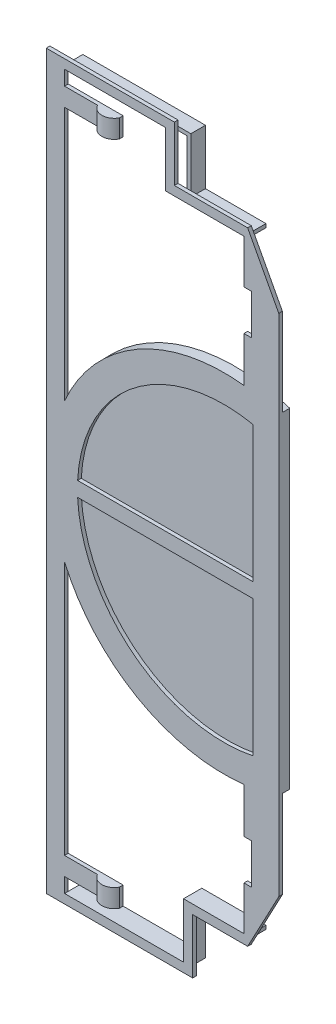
ISO-10303-21;
HEADER;
FILE_DESCRIPTION(('STEP AP214'),'2;1');
FILE_NAME('part.step','',(''),(''),'','','');
FILE_SCHEMA(('AUTOMOTIVE_DESIGN { 1 0 10303 214 1 1 1 1 }'));
ENDSEC;
DATA;
#1=APPLICATION_CONTEXT('core data for automotive mechanical design processes');
#2=APPLICATION_PROTOCOL_DEFINITION('international standard','automotive_design',2000,#1);
#3=PRODUCT_CONTEXT('',#1,'mechanical');
#4=PRODUCT('Part','Part','',(#3));
#5=PRODUCT_RELATED_PRODUCT_CATEGORY('part','',(#4));
#6=PRODUCT_DEFINITION_FORMATION('','',#4);
#7=PRODUCT_DEFINITION_CONTEXT('part definition',#1,'design');
#8=PRODUCT_DEFINITION('design','',#6,#7);
#9=PRODUCT_DEFINITION_SHAPE('','',#8);
#10=(LENGTH_UNIT() NAMED_UNIT(*) SI_UNIT(.MILLI.,.METRE.));
#11=(NAMED_UNIT(*) PLANE_ANGLE_UNIT() SI_UNIT($,.RADIAN.));
#12=(NAMED_UNIT(*) SI_UNIT($,.STERADIAN.) SOLID_ANGLE_UNIT());
#13=UNCERTAINTY_MEASURE_WITH_UNIT(LENGTH_MEASURE(1.E-05),#10,'distance_accuracy_value','');
#14=(GEOMETRIC_REPRESENTATION_CONTEXT(3) GLOBAL_UNCERTAINTY_ASSIGNED_CONTEXT((#13)) GLOBAL_UNIT_ASSIGNED_CONTEXT((#10,
#11,#12)) REPRESENTATION_CONTEXT('',''));
#15=CARTESIAN_POINT('',(0.,0.,0.));
#16=DIRECTION('',(0.,0.,1.));
#17=DIRECTION('',(1.,0.,0.));
#18=AXIS2_PLACEMENT_3D('',#15,#16,#17);
#19=CARTESIAN_POINT('',(6.68528849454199,97.5,1.));
#20=DIRECTION('',(1.,0.,0.));
#21=DIRECTION('',(0.,1.,0.));
#22=AXIS2_PLACEMENT_3D('',#19,#20,#21);
#23=PLANE('',#22);
#24=DIRECTION('',(0.,-1.,0.));
#25=VECTOR('',#24,1.);
#26=CARTESIAN_POINT('',(6.68528849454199,97.5,0.));
#27=LINE('',#26,#25);
#28=CARTESIAN_POINT('',(6.68528849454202,-93.5,0.));
#29=VERTEX_POINT('',#28);
#30=CARTESIAN_POINT('',(6.68528849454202,-97.5,0.));
#31=VERTEX_POINT('',#30);
#32=EDGE_CURVE('E45',#29,#31,#27,.T.);
#33=ORIENTED_EDGE('',*,*,#32,.F.);
#34=DIRECTION('',(0.,0.,1.));
#35=VECTOR('',#34,1.);
#36=CARTESIAN_POINT('',(6.68528849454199,-93.5,1.));
#37=LINE('',#36,#35);
#38=CARTESIAN_POINT('',(6.68528849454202,-93.5,1.));
#39=VERTEX_POINT('',#38);
#40=EDGE_CURVE('E492',#29,#39,#37,.T.);
#41=ORIENTED_EDGE('',*,*,#40,.T.);
#42=DIRECTION('',(0.,-1.,0.));
#43=VECTOR('',#42,1.);
#44=CARTESIAN_POINT('',(6.68528849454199,97.5,1.));
#45=LINE('',#44,#43);
#46=CARTESIAN_POINT('',(6.68528849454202,-97.5,1.));
#47=VERTEX_POINT('',#46);
#48=EDGE_CURVE('E818',#39,#47,#45,.T.);
#49=ORIENTED_EDGE('',*,*,#48,.T.);
#50=DIRECTION('',(0.,0.,-1.));
#51=VECTOR('',#50,1.);
#52=CARTESIAN_POINT('',(6.68528849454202,-97.5,1.));
#53=LINE('',#52,#51);
#54=EDGE_CURVE('E855',#47,#31,#53,.T.);
#55=ORIENTED_EDGE('',*,*,#54,.T.);
#56=EDGE_LOOP('',(#33,#41,#49,#55));
#57=FACE_BOUND('',#56,.T.);
#58=ADVANCED_FACE('F30',(#57),#23,.T.);
#59=CARTESIAN_POINT('',(6.68528849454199,97.5,1.));
#60=VERTEX_POINT('',#59);
#61=CARTESIAN_POINT('',(6.68528849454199,93.5,1.));
#62=VERTEX_POINT('',#61);
#63=EDGE_CURVE('E819',#60,#62,#45,.T.);
#64=ORIENTED_EDGE('',*,*,#63,.T.);
#65=DIRECTION('',(0.,0.,1.));
#66=VECTOR('',#65,1.);
#67=CARTESIAN_POINT('',(6.68528849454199,93.5,1.));
#68=LINE('',#67,#66);
#69=CARTESIAN_POINT('',(6.68528849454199,93.5,0.));
#70=VERTEX_POINT('',#69);
#71=EDGE_CURVE('E517',#70,#62,#68,.T.);
#72=ORIENTED_EDGE('',*,*,#71,.F.);
#73=CARTESIAN_POINT('',(6.68528849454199,97.5,0.));
#74=VERTEX_POINT('',#73);
#75=EDGE_CURVE('E800',#74,#70,#27,.T.);
#76=ORIENTED_EDGE('',*,*,#75,.F.);
#77=DIRECTION('',(0.,0.,-1.));
#78=VECTOR('',#77,1.);
#79=CARTESIAN_POINT('',(6.68528849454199,97.5,1.));
#80=LINE('',#79,#78);
#81=EDGE_CURVE('E857',#60,#74,#80,.T.);
#82=ORIENTED_EDGE('',*,*,#81,.F.);
#83=EDGE_LOOP('',(#64,#72,#76,#82));
#84=FACE_BOUND('',#83,.T.);
#85=ADVANCED_FACE('F1046',(#84),#23,.T.);
#86=CARTESIAN_POINT('',(55.7058736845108,-82.5,1.));
#87=DIRECTION('',(-1.,0.,0.));
#88=DIRECTION('',(0.,0.,1.));
#89=AXIS2_PLACEMENT_3D('',#86,#87,#88);
#90=PLANE('',#89);
#91=DIRECTION('',(0.,0.,1.));
#92=VECTOR('',#91,1.);
#93=CARTESIAN_POINT('',(55.7058736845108,-70.5,1.));
#94=LINE('',#93,#92);
#95=CARTESIAN_POINT('',(55.7058736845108,-70.5,0.));
#96=VERTEX_POINT('',#95);
#97=CARTESIAN_POINT('',(55.7058736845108,-70.5,1.));
#98=VERTEX_POINT('',#97);
#99=EDGE_CURVE('E11',#96,#98,#94,.T.);
#100=ORIENTED_EDGE('',*,*,#99,.F.);
#101=DIRECTION('',(0.,1.,0.));
#102=VECTOR('',#101,1.);
#103=CARTESIAN_POINT('',(55.7058736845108,-82.5,0.));
#104=LINE('',#103,#102);
#105=CARTESIAN_POINT('',(55.7058736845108,-82.5,0.));
#106=VERTEX_POINT('',#105);
#107=EDGE_CURVE('E805',#106,#96,#104,.T.);
#108=ORIENTED_EDGE('',*,*,#107,.F.);
#109=DIRECTION('',(0.,0.,-1.));
#110=VECTOR('',#109,1.);
#111=CARTESIAN_POINT('',(55.7058736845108,-82.5,1.));
#112=LINE('',#111,#110);
#113=CARTESIAN_POINT('',(55.7058736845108,-82.5,1.));
#114=VERTEX_POINT('',#113);
#115=EDGE_CURVE('E848',#114,#106,#112,.T.);
#116=ORIENTED_EDGE('',*,*,#115,.F.);
#117=DIRECTION('',(0.,1.,0.));
#118=VECTOR('',#117,1.);
#119=CARTESIAN_POINT('',(55.7058736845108,-82.5,1.));
#120=LINE('',#119,#118);
#121=EDGE_CURVE('E830',#114,#98,#120,.T.);
#122=ORIENTED_EDGE('',*,*,#121,.T.);
#123=EDGE_LOOP('',(#100,#108,#116,#122));
#124=FACE_BOUND('',#123,.T.);
#125=ADVANCED_FACE('F1020',(#124),#90,.T.);
#126=CARTESIAN_POINT('',(55.7058736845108,45.,1.));
#127=DIRECTION('',(-1.,0.,0.));
#128=DIRECTION('',(0.,0.,1.));
#129=AXIS2_PLACEMENT_3D('',#126,#127,#128);
#130=PLANE('',#129);
#131=DIRECTION('',(0.,0.,-1.));
#132=VECTOR('',#131,1.);
#133=CARTESIAN_POINT('',(55.7058736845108,70.5,1.));
#134=LINE('',#133,#132);
#135=CARTESIAN_POINT('',(55.7058736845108,70.5,1.));
#136=VERTEX_POINT('',#135);
#137=CARTESIAN_POINT('',(55.7058736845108,70.5,0.));
#138=VERTEX_POINT('',#137);
#139=EDGE_CURVE('E961',#136,#138,#134,.T.);
#140=ORIENTED_EDGE('',*,*,#139,.F.);
#141=DIRECTION('',(0.,1.,0.));
#142=VECTOR('',#141,1.);
#143=CARTESIAN_POINT('',(55.7058736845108,45.,1.));
#144=LINE('',#143,#142);
#145=CARTESIAN_POINT('',(55.7058736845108,82.5,1.));
#146=VERTEX_POINT('',#145);
#147=EDGE_CURVE('E840',#136,#146,#144,.T.);
#148=ORIENTED_EDGE('',*,*,#147,.T.);
#149=DIRECTION('',(0.,0.,-1.));
#150=VECTOR('',#149,1.);
#151=CARTESIAN_POINT('',(55.7058736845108,82.5,1.));
#152=LINE('',#151,#150);
#153=CARTESIAN_POINT('',(55.7058736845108,82.5,0.));
#154=VERTEX_POINT('',#153);
#155=EDGE_CURVE('E845',#146,#154,#152,.T.);
#156=ORIENTED_EDGE('',*,*,#155,.T.);
#157=DIRECTION('',(0.,1.,0.));
#158=VECTOR('',#157,1.);
#159=CARTESIAN_POINT('',(55.7058736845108,45.,0.));
#160=LINE('',#159,#158);
#161=EDGE_CURVE('E808',#138,#154,#160,.T.);
#162=ORIENTED_EDGE('',*,*,#161,.F.);
#163=EDGE_LOOP('',(#140,#148,#156,#162));
#164=FACE_BOUND('',#163,.T.);
#165=ADVANCED_FACE('F1159',(#164),#130,.T.);
#166=CARTESIAN_POINT('',(58.2058736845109,45.,1.));
#167=DIRECTION('',(-1.,0.,0.));
#168=DIRECTION('',(0.,0.,1.));
#169=AXIS2_PLACEMENT_3D('',#166,#167,#168);
#170=PLANE('',#169);
#171=DIRECTION('',(0.,0.,1.));
#172=VECTOR('',#171,1.);
#173=CARTESIAN_POINT('',(58.2058736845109,39.1918358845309,-2.));
#174=LINE('',#173,#172);
#175=CARTESIAN_POINT('',(58.2058736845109,39.1918358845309,1.));
#176=VERTEX_POINT('',#175);
#177=CARTESIAN_POINT('',(58.2058736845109,39.1918358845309,0.));
#178=VERTEX_POINT('',#177);
#179=EDGE_CURVE('E956',#176,#178,#174,.F.);
#180=ORIENTED_EDGE('',*,*,#179,.T.);
#181=DIRECTION('',(0.,-1.,0.));
#182=VECTOR('',#181,1.);
#183=CARTESIAN_POINT('',(58.2058736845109,2.,-1.84171278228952E-13));
#184=LINE('',#183,#182);
#185=CARTESIAN_POINT('',(58.2058736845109,2.,-1.84171278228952E-13));
#186=VERTEX_POINT('',#185);
#187=EDGE_CURVE('E574',#178,#186,#184,.T.);
#188=ORIENTED_EDGE('',*,*,#187,.T.);
#189=DIRECTION('',(0.,0.,1.));
#190=VECTOR('',#189,1.);
#191=CARTESIAN_POINT('',(58.2058736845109,2.,1.));
#192=LINE('',#191,#190);
#193=CARTESIAN_POINT('',(58.2058736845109,2.00000000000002,1.));
#194=VERTEX_POINT('',#193);
#195=EDGE_CURVE('E951',#186,#194,#192,.T.);
#196=ORIENTED_EDGE('',*,*,#195,.T.);
#197=DIRECTION('',(0.,1.,0.));
#198=VECTOR('',#197,1.);
#199=CARTESIAN_POINT('',(58.2058736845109,45.,1.));
#200=LINE('',#199,#198);
#201=EDGE_CURVE('E833',#194,#176,#200,.T.);
#202=ORIENTED_EDGE('',*,*,#201,.T.);
#203=EDGE_LOOP('',(#180,#188,#196,#202));
#204=FACE_BOUND('',#203,.T.);
#205=ADVANCED_FACE('F1074',(#204),#170,.T.);
#206=CARTESIAN_POINT('',(50.2058736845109,0.,-2.));
#207=DIRECTION('',(0.,0.,1.));
#208=DIRECTION('',(1.,0.,0.));
#209=AXIS2_PLACEMENT_3D('',#206,#207,#208);
#210=CYLINDRICAL_SURFACE('',#209,40.);
#211=CARTESIAN_POINT('',(50.2058736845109,0.,-1.588581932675E-13));
#212=DIRECTION('',(0.,0.,-1.));
#213=DIRECTION('',(-1.,0.,0.));
#214=AXIS2_PLACEMENT_3D('',#211,#212,#213);
#215=CIRCLE('',#214,40.);
#216=CARTESIAN_POINT('',(10.2559049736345,2.,-1.0842021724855E-13));
#217=VERTEX_POINT('',#216);
#218=EDGE_CURVE('E572',#217,#178,#215,.T.);
#219=ORIENTED_EDGE('',*,*,#218,.T.);
#220=ORIENTED_EDGE('',*,*,#179,.F.);
#221=CARTESIAN_POINT('',(50.2058736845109,0.,1.));
#222=DIRECTION('',(0.,0.,1.));
#223=DIRECTION('',(1.,0.,0.));
#224=AXIS2_PLACEMENT_3D('',#221,#222,#223);
#225=CIRCLE('',#224,40.);
#226=CARTESIAN_POINT('',(10.2559049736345,2.,1.));
#227=VERTEX_POINT('',#226);
#228=EDGE_CURVE('E748',#176,#227,#225,.T.);
#229=ORIENTED_EDGE('',*,*,#228,.T.);
#230=DIRECTION('',(0.,0.,1.));
#231=VECTOR('',#230,1.);
#232=CARTESIAN_POINT('',(10.2559049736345,2.,-2.));
#233=LINE('',#232,#231);
#234=EDGE_CURVE('E763',#217,#227,#233,.T.);
#235=ORIENTED_EDGE('',*,*,#234,.F.);
#236=EDGE_LOOP('',(#219,#220,#229,#235));
#237=FACE_BOUND('',#236,.T.);
#238=ADVANCED_FACE('F1238',(#237),#210,.F.);
#239=CARTESIAN_POINT('',(10.2559049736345,2.,-2.));
#240=DIRECTION('',(0.,-1.,0.));
#241=DIRECTION('',(0.,0.,-1.));
#242=AXIS2_PLACEMENT_3D('',#239,#240,#241);
#243=PLANE('',#242);
#244=DIRECTION('',(-1.,0.,0.));
#245=VECTOR('',#244,1.);
#246=CARTESIAN_POINT('',(10.2559049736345,2.,0.));
#247=LINE('',#246,#245);
#248=EDGE_CURVE('E577',#186,#217,#247,.T.);
#249=ORIENTED_EDGE('',*,*,#248,.T.);
#250=ORIENTED_EDGE('',*,*,#234,.T.);
#251=DIRECTION('',(1.,0.,0.));
#252=VECTOR('',#251,1.);
#253=CARTESIAN_POINT('',(10.2559049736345,2.,1.));
#254=LINE('',#253,#252);
#255=EDGE_CURVE('E751',#227,#194,#254,.T.);
#256=ORIENTED_EDGE('',*,*,#255,.T.);
#257=ORIENTED_EDGE('',*,*,#195,.F.);
#258=EDGE_LOOP('',(#249,#250,#256,#257));
#259=FACE_BOUND('',#258,.T.);
#260=ADVANCED_FACE('F1233',(#259),#243,.F.);
#261=DIRECTION('',(0.,0.,-1.));
#262=VECTOR('',#261,1.);
#263=CARTESIAN_POINT('',(58.2058736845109,-2.,1.));
#264=LINE('',#263,#262);
#265=CARTESIAN_POINT('',(58.2058736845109,-1.99999999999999,1.));
#266=VERTEX_POINT('',#265);
#267=CARTESIAN_POINT('',(58.2058736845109,-2.,-1.0842021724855E-13));
#268=VERTEX_POINT('',#267);
#269=EDGE_CURVE('E944',#266,#268,#264,.T.);
#270=ORIENTED_EDGE('',*,*,#269,.T.);
#271=DIRECTION('',(0.,-1.,0.));
#272=VECTOR('',#271,1.);
#273=CARTESIAN_POINT('',(58.2058736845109,-39.1918358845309,-1.84171278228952E-13));
#274=LINE('',#273,#272);
#275=CARTESIAN_POINT('',(58.2058736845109,-39.1918358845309,0.));
#276=VERTEX_POINT('',#275);
#277=EDGE_CURVE('E590',#268,#276,#274,.T.);
#278=ORIENTED_EDGE('',*,*,#277,.T.);
#279=DIRECTION('',(0.,0.,1.));
#280=VECTOR('',#279,1.);
#281=CARTESIAN_POINT('',(58.2058736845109,-39.1918358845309,-2.));
#282=LINE('',#281,#280);
#283=CARTESIAN_POINT('',(58.2058736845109,-39.1918358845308,1.));
#284=VERTEX_POINT('',#283);
#285=EDGE_CURVE('E947',#276,#284,#282,.T.);
#286=ORIENTED_EDGE('',*,*,#285,.T.);
#287=EDGE_CURVE('E835',#284,#266,#200,.T.);
#288=ORIENTED_EDGE('',*,*,#287,.T.);
#289=EDGE_LOOP('',(#270,#278,#286,#288));
#290=FACE_BOUND('',#289,.T.);
#291=ADVANCED_FACE('F1163',(#290),#170,.T.);
#292=CARTESIAN_POINT('',(50.2058736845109,0.,-2.));
#293=DIRECTION('',(0.,0.,1.));
#294=DIRECTION('',(1.,0.,0.));
#295=AXIS2_PLACEMENT_3D('',#292,#293,#294);
#296=CYLINDRICAL_SURFACE('',#295,40.);
#297=CARTESIAN_POINT('',(50.2058736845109,0.,-1.588581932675E-13));
#298=DIRECTION('',(0.,0.,-1.));
#299=DIRECTION('',(-1.,0.,0.));
#300=AXIS2_PLACEMENT_3D('',#297,#298,#299);
#301=CIRCLE('',#300,40.);
#302=CARTESIAN_POINT('',(10.2559049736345,-2.,0.));
#303=VERTEX_POINT('',#302);
#304=EDGE_CURVE('E585',#276,#303,#301,.T.);
#305=ORIENTED_EDGE('',*,*,#304,.T.);
#306=DIRECTION('',(0.,0.,1.));
#307=VECTOR('',#306,1.);
#308=CARTESIAN_POINT('',(10.2559049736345,-2.,-2.));
#309=LINE('',#308,#307);
#310=CARTESIAN_POINT('',(10.2559049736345,-2.,1.));
#311=VERTEX_POINT('',#310);
#312=EDGE_CURVE('E744',#303,#311,#309,.T.);
#313=ORIENTED_EDGE('',*,*,#312,.T.);
#314=CARTESIAN_POINT('',(50.2058736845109,0.,1.));
#315=DIRECTION('',(0.,0.,1.));
#316=DIRECTION('',(1.,0.,0.));
#317=AXIS2_PLACEMENT_3D('',#314,#315,#316);
#318=CIRCLE('',#317,40.);
#319=EDGE_CURVE('E729',#311,#284,#318,.T.);
#320=ORIENTED_EDGE('',*,*,#319,.T.);
#321=ORIENTED_EDGE('',*,*,#285,.F.);
#322=EDGE_LOOP('',(#305,#313,#320,#321));
#323=FACE_BOUND('',#322,.T.);
#324=ADVANCED_FACE('F1173',(#323),#296,.F.);
#325=CARTESIAN_POINT('',(10.2559049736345,-2.,-2.));
#326=DIRECTION('',(0.,1.,0.));
#327=DIRECTION('',(0.,0.,1.));
#328=AXIS2_PLACEMENT_3D('',#325,#326,#327);
#329=PLANE('',#328);
#330=DIRECTION('',(1.,0.,0.));
#331=VECTOR('',#330,1.);
#332=CARTESIAN_POINT('',(58.2058736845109,-2.,-1.84171278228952E-13));
#333=LINE('',#332,#331);
#334=EDGE_CURVE('E588',#303,#268,#333,.T.);
#335=ORIENTED_EDGE('',*,*,#334,.T.);
#336=ORIENTED_EDGE('',*,*,#269,.F.);
#337=DIRECTION('',(-1.,0.,0.));
#338=VECTOR('',#337,1.);
#339=CARTESIAN_POINT('',(10.2559049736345,-2.,1.));
#340=LINE('',#339,#338);
#341=EDGE_CURVE('E732',#266,#311,#340,.T.);
#342=ORIENTED_EDGE('',*,*,#341,.T.);
#343=ORIENTED_EDGE('',*,*,#312,.F.);
#344=EDGE_LOOP('',(#335,#336,#342,#343));
#345=FACE_BOUND('',#344,.T.);
#346=ADVANCED_FACE('F1169',(#345),#329,.F.);
#347=CARTESIAN_POINT('',(147.018373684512,-85.,0.));
#348=DIRECTION('',(0.,0.,-1.));
#349=DIRECTION('',(-1.,0.,0.));
#350=AXIS2_PLACEMENT_3D('',#347,#348,#349);
#351=PLANE('',#350);
#352=DIRECTION('',(0.,1.,0.));
#353=VECTOR('',#352,1.);
#354=CARTESIAN_POINT('',(34.3253942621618,82.5,0.));
#355=LINE('',#354,#353);
#356=CARTESIAN_POINT('',(34.3253942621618,82.5,0.));
#357=VERTEX_POINT('',#356);
#358=CARTESIAN_POINT('',(34.3253942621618,97.5,0.));
#359=VERTEX_POINT('',#358);
#360=EDGE_CURVE('E797',#357,#359,#355,.T.);
#361=ORIENTED_EDGE('',*,*,#360,.T.);
#362=DIRECTION('',(-1.,0.,0.));
#363=VECTOR('',#362,1.);
#364=CARTESIAN_POINT('',(39.1832299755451,97.5,0.));
#365=LINE('',#364,#363);
#366=CARTESIAN_POINT('',(36.685288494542,97.5,0.));
#367=VERTEX_POINT('',#366);
#368=EDGE_CURVE('E653',#367,#359,#365,.T.);
#369=ORIENTED_EDGE('',*,*,#368,.F.);
#370=DIRECTION('',(0.,1.,0.));
#371=VECTOR('',#370,1.);
#372=CARTESIAN_POINT('',(36.685288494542,85.,0.));
#373=LINE('',#372,#371);
#374=CARTESIAN_POINT('',(36.685288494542,85.,0.));
#375=VERTEX_POINT('',#374);
#376=EDGE_CURVE('E870',#375,#367,#373,.T.);
#377=ORIENTED_EDGE('',*,*,#376,.F.);
#378=DIRECTION('',(-1.,0.,0.));
#379=VECTOR('',#378,1.);
#380=CARTESIAN_POINT('',(56.7058736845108,85.,0.));
#381=LINE('',#380,#379);
#382=CARTESIAN_POINT('',(39.1832299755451,85.,0.));
#383=VERTEX_POINT('',#382);
#384=EDGE_CURVE('E865',#383,#375,#381,.T.);
#385=ORIENTED_EDGE('',*,*,#384,.F.);
#386=DIRECTION('',(0.,1.,0.));
#387=VECTOR('',#386,1.);
#388=CARTESIAN_POINT('',(39.1832299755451,82.5,0.));
#389=LINE('',#388,#387);
#390=CARTESIAN_POINT('',(39.1832299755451,82.5,0.));
#391=VERTEX_POINT('',#390);
#392=EDGE_CURVE('E675',#391,#383,#389,.T.);
#393=ORIENTED_EDGE('',*,*,#392,.F.);
#394=DIRECTION('',(-1.,0.,0.));
#395=VECTOR('',#394,1.);
#396=CARTESIAN_POINT('',(55.7058736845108,82.5,0.));
#397=LINE('',#396,#395);
#398=EDGE_CURVE('E812',#391,#357,#397,.T.);
#399=ORIENTED_EDGE('',*,*,#398,.T.);
#400=EDGE_LOOP('',(#361,#369,#377,#385,#393,#399));
#401=FACE_BOUND('',#400,.T.);
#402=ADVANCED_FACE('F1075',(#401),#351,.T.);
#403=DIRECTION('',(-1.,0.,0.));
#404=VECTOR('',#403,1.);
#405=CARTESIAN_POINT('',(147.018373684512,-70.5,0.));
#406=LINE('',#405,#404);
#407=CARTESIAN_POINT('',(57.7058736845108,-70.5,0.));
#408=VERTEX_POINT('',#407);
#409=EDGE_CURVE('E552',#408,#96,#406,.T.);
#410=ORIENTED_EDGE('',*,*,#409,.F.);
#411=DIRECTION('',(0.,-1.,0.));
#412=VECTOR('',#411,1.);
#413=CARTESIAN_POINT('',(57.7058736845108,-85.,0.));
#414=LINE('',#413,#412);
#415=CARTESIAN_POINT('',(57.7058736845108,-59.5,0.));
#416=VERTEX_POINT('',#415);
#417=EDGE_CURVE('E554',#416,#408,#414,.T.);
#418=ORIENTED_EDGE('',*,*,#417,.F.);
#419=DIRECTION('',(1.,0.,0.));
#420=VECTOR('',#419,1.);
#421=CARTESIAN_POINT('',(147.018373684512,-59.5000000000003,0.));
#422=LINE('',#421,#420);
#423=CARTESIAN_POINT('',(55.7058736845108,-59.5,0.));
#424=VERTEX_POINT('',#423);
#425=EDGE_CURVE('E549',#424,#416,#422,.T.);
#426=ORIENTED_EDGE('',*,*,#425,.F.);
#427=CARTESIAN_POINT('',(55.7058736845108,-47.1805044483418,0.));
#428=VERTEX_POINT('',#427);
#429=EDGE_CURVE('E803',#424,#428,#104,.T.);
#430=ORIENTED_EDGE('',*,*,#429,.T.);
#431=CARTESIAN_POINT('',(50.2058736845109,0.,0.));
#432=DIRECTION('',(0.,0.,-1.));
#433=DIRECTION('',(-1.,0.,0.));
#434=AXIS2_PLACEMENT_3D('',#431,#432,#433);
#435=CIRCLE('',#434,47.5);
#436=CARTESIAN_POINT('',(65.2058736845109,-45.0693909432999,0.));
#437=VERTEX_POINT('',#436);
#438=EDGE_CURVE('E788',#437,#428,#435,.T.);
#439=ORIENTED_EDGE('',*,*,#438,.F.);
#440=DIRECTION('',(0.,1.,0.));
#441=VECTOR('',#440,1.);
#442=CARTESIAN_POINT('',(65.2058736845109,69.,0.));
#443=LINE('',#442,#441);
#444=CARTESIAN_POINT('',(65.2058736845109,-69.,0.));
#445=VERTEX_POINT('',#444);
#446=EDGE_CURVE('E886',#445,#437,#443,.T.);
#447=ORIENTED_EDGE('',*,*,#446,.F.);
#448=DIRECTION('',(0.469155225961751,0.88311571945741,0.));
#449=VECTOR('',#448,1.);
#450=CARTESIAN_POINT('',(56.7058736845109,-85.,0.));
#451=LINE('',#450,#449);
#452=CARTESIAN_POINT('',(56.7058736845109,-85.,0.));
#453=VERTEX_POINT('',#452);
#454=EDGE_CURVE('E883',#453,#445,#451,.T.);
#455=ORIENTED_EDGE('',*,*,#454,.F.);
#456=DIRECTION('',(1.,0.,0.));
#457=VECTOR('',#456,1.);
#458=CARTESIAN_POINT('',(56.7058736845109,-85.,0.));
#459=LINE('',#458,#457);
#460=CARTESIAN_POINT('',(41.685288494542,-85.,0.));
#461=VERTEX_POINT('',#460);
#462=EDGE_CURVE('E881',#461,#453,#459,.T.);
#463=ORIENTED_EDGE('',*,*,#462,.F.);
#464=DIRECTION('',(0.,1.,0.));
#465=VECTOR('',#464,1.);
#466=CARTESIAN_POINT('',(41.685288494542,-85.,0.));
#467=LINE('',#466,#465);
#468=CARTESIAN_POINT('',(41.685288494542,-100.,0.));
#469=VERTEX_POINT('',#468);
#470=EDGE_CURVE('E879',#469,#461,#467,.T.);
#471=ORIENTED_EDGE('',*,*,#470,.F.);
#472=DIRECTION('',(1.,0.,0.));
#473=VECTOR('',#472,1.);
#474=CARTESIAN_POINT('',(1.68528849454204,-100.,0.));
#475=LINE('',#474,#473);
#476=CARTESIAN_POINT('',(1.68528849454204,-100.,0.));
#477=VERTEX_POINT('',#476);
#478=EDGE_CURVE('E877',#477,#469,#475,.T.);
#479=ORIENTED_EDGE('',*,*,#478,.F.);
#480=DIRECTION('',(0.,-1.,0.));
#481=VECTOR('',#480,1.);
#482=CARTESIAN_POINT('',(1.68528849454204,-100.,0.));
#483=LINE('',#482,#481);
#484=CARTESIAN_POINT('',(1.68528849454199,100.,0.));
#485=VERTEX_POINT('',#484);
#486=EDGE_CURVE('E875',#485,#477,#483,.T.);
#487=ORIENTED_EDGE('',*,*,#486,.F.);
#488=DIRECTION('',(-1.,0.,0.));
#489=VECTOR('',#488,1.);
#490=CARTESIAN_POINT('',(1.68528849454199,100.,0.));
#491=LINE('',#490,#489);
#492=CARTESIAN_POINT('',(36.685288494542,100.,0.));
#493=VERTEX_POINT('',#492);
#494=EDGE_CURVE('E873',#493,#485,#491,.T.);
#495=ORIENTED_EDGE('',*,*,#494,.F.);
#496=CARTESIAN_POINT('',(36.685288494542,98.5,0.));
#497=VERTEX_POINT('',#496);
#498=EDGE_CURVE('E869',#497,#493,#373,.T.);
#499=ORIENTED_EDGE('',*,*,#498,.F.);
#500=DIRECTION('',(-1.,0.,0.));
#501=VECTOR('',#500,1.);
#502=CARTESIAN_POINT('',(39.1832299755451,98.5,0.));
#503=LINE('',#502,#501);
#504=CARTESIAN_POINT('',(6.685288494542,98.5,0.));
#505=VERTEX_POINT('',#504);
#506=EDGE_CURVE('E660',#497,#505,#503,.T.);
#507=ORIENTED_EDGE('',*,*,#506,.T.);
#508=DIRECTION('',(0.,-1.,0.));
#509=VECTOR('',#508,1.);
#510=CARTESIAN_POINT('',(6.68528849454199,98.5,0.));
#511=LINE('',#510,#509);
#512=EDGE_CURVE('E657',#505,#74,#511,.T.);
#513=ORIENTED_EDGE('',*,*,#512,.T.);
#514=ORIENTED_EDGE('',*,*,#75,.T.);
#515=DIRECTION('',(-1.,0.,0.));
#516=VECTOR('',#515,1.);
#517=CARTESIAN_POINT('',(6.68528849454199,93.5,0.));
#518=LINE('',#517,#516);
#519=CARTESIAN_POINT('',(21.685288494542,93.5,0.));
#520=VERTEX_POINT('',#519);
#521=EDGE_CURVE('E526',#520,#70,#518,.T.);
#522=ORIENTED_EDGE('',*,*,#521,.F.);
#523=DIRECTION('',(0.,-1.,0.));
#524=VECTOR('',#523,1.);
#525=CARTESIAN_POINT('',(21.685288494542,93.5,0.));
#526=LINE('',#525,#524);
#527=CARTESIAN_POINT('',(21.685288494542,88.5,0.));
#528=VERTEX_POINT('',#527);
#529=EDGE_CURVE('E529',#520,#528,#526,.T.);
#530=ORIENTED_EDGE('',*,*,#529,.T.);
#531=DIRECTION('',(-1.,0.,0.));
#532=VECTOR('',#531,1.);
#533=CARTESIAN_POINT('',(6.68528849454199,88.5,0.));
#534=LINE('',#533,#532);
#535=CARTESIAN_POINT('',(6.68528849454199,88.5,0.));
#536=VERTEX_POINT('',#535);
#537=EDGE_CURVE('E514',#528,#536,#534,.T.);
#538=ORIENTED_EDGE('',*,*,#537,.T.);
#539=CARTESIAN_POINT('',(6.685288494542,19.0317803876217,0.));
#540=VERTEX_POINT('',#539);
#541=EDGE_CURVE('E804',#536,#540,#27,.T.);
#542=ORIENTED_EDGE('',*,*,#541,.T.);
#543=CARTESIAN_POINT('',(6.68528849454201,-19.0317803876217,0.));
#544=VERTEX_POINT('',#543);
#545=EDGE_CURVE('E787',#544,#540,#435,.T.);
#546=ORIENTED_EDGE('',*,*,#545,.F.);
#547=CARTESIAN_POINT('',(6.68528849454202,-88.5,0.));
#548=VERTEX_POINT('',#547);
#549=EDGE_CURVE('E479',#544,#548,#27,.T.);
#550=ORIENTED_EDGE('',*,*,#549,.T.);
#551=DIRECTION('',(-1.,0.,0.));
#552=VECTOR('',#551,1.);
#553=CARTESIAN_POINT('',(6.68528849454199,-88.5,0.));
#554=LINE('',#553,#552);
#555=CARTESIAN_POINT('',(21.685288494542,-88.5,0.));
#556=VERTEX_POINT('',#555);
#557=EDGE_CURVE('E476',#556,#548,#554,.T.);
#558=ORIENTED_EDGE('',*,*,#557,.F.);
#559=DIRECTION('',(0.,1.,0.));
#560=VECTOR('',#559,1.);
#561=CARTESIAN_POINT('',(21.685288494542,-93.5,0.));
#562=LINE('',#561,#560);
#563=CARTESIAN_POINT('',(21.685288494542,-93.5,0.));
#564=VERTEX_POINT('',#563);
#565=EDGE_CURVE('E461',#564,#556,#562,.T.);
#566=ORIENTED_EDGE('',*,*,#565,.F.);
#567=DIRECTION('',(-1.,0.,0.));
#568=VECTOR('',#567,1.);
#569=CARTESIAN_POINT('',(6.68528849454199,-93.5,0.));
#570=LINE('',#569,#568);
#571=EDGE_CURVE('E494',#564,#29,#570,.T.);
#572=ORIENTED_EDGE('',*,*,#571,.T.);
#573=ORIENTED_EDGE('',*,*,#32,.T.);
#574=DIRECTION('',(0.,1.,0.));
#575=VECTOR('',#574,1.);
#576=CARTESIAN_POINT('',(6.68528849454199,-98.5,0.));
#577=LINE('',#576,#575);
#578=CARTESIAN_POINT('',(6.685288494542,-98.5,0.));
#579=VERTEX_POINT('',#578);
#580=EDGE_CURVE('E613',#579,#31,#577,.T.);
#581=ORIENTED_EDGE('',*,*,#580,.F.);
#582=DIRECTION('',(-1.,0.,0.));
#583=VECTOR('',#582,1.);
#584=CARTESIAN_POINT('',(39.1832299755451,-98.5,0.));
#585=LINE('',#584,#583);
#586=CARTESIAN_POINT('',(40.1832299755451,-98.5,0.));
#587=VERTEX_POINT('',#586);
#588=EDGE_CURVE('E610',#587,#579,#585,.T.);
#589=ORIENTED_EDGE('',*,*,#588,.F.);
#590=DIRECTION('',(0.,-1.,0.));
#591=VECTOR('',#590,1.);
#592=CARTESIAN_POINT('',(40.1832299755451,-82.5,0.));
#593=LINE('',#592,#591);
#594=CARTESIAN_POINT('',(40.1832299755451,-83.5,0.));
#595=VERTEX_POINT('',#594);
#596=EDGE_CURVE('E607',#595,#587,#593,.T.);
#597=ORIENTED_EDGE('',*,*,#596,.F.);
#598=DIRECTION('',(-1.,0.,0.));
#599=VECTOR('',#598,1.);
#600=CARTESIAN_POINT('',(55.7058736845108,-83.5,0.));
#601=LINE('',#600,#599);
#602=CARTESIAN_POINT('',(56.7058736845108,-83.5,0.));
#603=VERTEX_POINT('',#602);
#604=EDGE_CURVE('E604',#603,#595,#601,.T.);
#605=ORIENTED_EDGE('',*,*,#604,.F.);
#606=DIRECTION('',(0.,-1.,0.));
#607=VECTOR('',#606,1.);
#608=CARTESIAN_POINT('',(56.7058736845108,-82.5,0.));
#609=LINE('',#608,#607);
#610=CARTESIAN_POINT('',(56.7058736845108,-82.5,0.));
#611=VERTEX_POINT('',#610);
#612=EDGE_CURVE('E601',#611,#603,#609,.T.);
#613=ORIENTED_EDGE('',*,*,#612,.F.);
#614=DIRECTION('',(-1.,0.,0.));
#615=VECTOR('',#614,1.);
#616=CARTESIAN_POINT('',(55.7058736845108,-82.5,0.));
#617=LINE('',#616,#615);
#618=EDGE_CURVE('E598',#611,#106,#617,.T.);
#619=ORIENTED_EDGE('',*,*,#618,.T.);
#620=ORIENTED_EDGE('',*,*,#107,.T.);
#621=EDGE_LOOP('',(#410,#418,#426,#430,#439,#447,#455,#463,#471,#479,#487,#495,#499,#507,#513,
#514,#522,#530,#538,#542,#546,#550,#558,#566,#572,#573,#581,#589,#597,#605,#613,#619,#620));
#622=FACE_BOUND('',#621,.T.);
#623=ADVANCED_FACE('F478',(#622),#351,.T.);
#624=DIRECTION('',(0.,0.,1.));
#625=VECTOR('',#624,1.);
#626=CARTESIAN_POINT('',(6.68528849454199,88.5,1.));
#627=LINE('',#626,#625);
#628=CARTESIAN_POINT('',(6.68528849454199,88.5,1.));
#629=VERTEX_POINT('',#628);
#630=EDGE_CURVE('E472',#536,#629,#627,.T.);
#631=ORIENTED_EDGE('',*,*,#630,.T.);
#632=CARTESIAN_POINT('',(6.685288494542,19.0317803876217,1.));
#633=VERTEX_POINT('',#632);
#634=EDGE_CURVE('E822',#629,#633,#45,.T.);
#635=ORIENTED_EDGE('',*,*,#634,.T.);
#636=DIRECTION('',(0.,0.,1.));
#637=VECTOR('',#636,1.);
#638=CARTESIAN_POINT('',(6.68528849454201,19.0317803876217,-2.));
#639=LINE('',#638,#637);
#640=EDGE_CURVE('E794',#540,#633,#639,.T.);
#641=ORIENTED_EDGE('',*,*,#640,.F.);
#642=ORIENTED_EDGE('',*,*,#541,.F.);
#643=EDGE_LOOP('',(#631,#635,#641,#642));
#644=FACE_BOUND('',#643,.T.);
#645=ADVANCED_FACE('F1052',(#644),#23,.T.);
#646=DIRECTION('',(0.,-1.,0.));
#647=VECTOR('',#646,1.);
#648=CARTESIAN_POINT('',(58.2058736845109,2.,-1.00000000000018));
#649=LINE('',#648,#647);
#650=CARTESIAN_POINT('',(58.2058736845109,39.1918358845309,-1.00000000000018));
#651=VERTEX_POINT('',#650);
#652=CARTESIAN_POINT('',(58.2058736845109,2.,-1.00000000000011));
#653=VERTEX_POINT('',#652);
#654=EDGE_CURVE('E581',#651,#653,#649,.T.);
#655=ORIENTED_EDGE('',*,*,#654,.F.);
#656=CARTESIAN_POINT('',(58.2058736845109,39.1918358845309,-2.));
#657=VERTEX_POINT('',#656);
#658=EDGE_CURVE('E955',#651,#657,#174,.F.);
#659=ORIENTED_EDGE('',*,*,#658,.T.);
#660=DIRECTION('',(0.,1.,0.));
#661=VECTOR('',#660,1.);
#662=CARTESIAN_POINT('',(58.2058736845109,2.,-2.));
#663=LINE('',#662,#661);
#664=CARTESIAN_POINT('',(58.2058736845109,2.,-2.));
#665=VERTEX_POINT('',#664);
#666=EDGE_CURVE('E760',#665,#657,#663,.T.);
#667=ORIENTED_EDGE('',*,*,#666,.F.);
#668=EDGE_CURVE('E952',#665,#653,#192,.T.);
#669=ORIENTED_EDGE('',*,*,#668,.T.);
#670=EDGE_LOOP('',(#655,#659,#667,#669));
#671=FACE_BOUND('',#670,.T.);
#672=ADVANCED_FACE('F1065',(#671),#170,.T.);
#673=DIRECTION('',(0.,-1.,0.));
#674=VECTOR('',#673,1.);
#675=CARTESIAN_POINT('',(58.2058736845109,-39.1918358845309,-1.00000000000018));
#676=LINE('',#675,#674);
#677=CARTESIAN_POINT('',(58.2058736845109,-2.,-1.00000000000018));
#678=VERTEX_POINT('',#677);
#679=CARTESIAN_POINT('',(58.2058736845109,-39.1918358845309,-1.00000000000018));
#680=VERTEX_POINT('',#679);
#681=EDGE_CURVE('E596',#678,#680,#676,.T.);
#682=ORIENTED_EDGE('',*,*,#681,.F.);
#683=CARTESIAN_POINT('',(58.2058736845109,-2.,-2.));
#684=VERTEX_POINT('',#683);
#685=EDGE_CURVE('E943',#678,#684,#264,.T.);
#686=ORIENTED_EDGE('',*,*,#685,.T.);
#687=DIRECTION('',(0.,1.,0.));
#688=VECTOR('',#687,1.);
#689=CARTESIAN_POINT('',(58.2058736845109,-39.1918358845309,-2.));
#690=LINE('',#689,#688);
#691=CARTESIAN_POINT('',(58.2058736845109,-39.1918358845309,-2.));
#692=VERTEX_POINT('',#691);
#693=EDGE_CURVE('E738',#692,#684,#690,.T.);
#694=ORIENTED_EDGE('',*,*,#693,.F.);
#695=EDGE_CURVE('E948',#692,#680,#282,.T.);
#696=ORIENTED_EDGE('',*,*,#695,.T.);
#697=EDGE_LOOP('',(#682,#686,#694,#696));
#698=FACE_BOUND('',#697,.T.);
#699=ADVANCED_FACE('F1071',(#698),#170,.T.);
#700=CARTESIAN_POINT('',(147.018373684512,-85.,1.));
#701=DIRECTION('',(0.,0.,-1.));
#702=DIRECTION('',(-1.,0.,0.));
#703=AXIS2_PLACEMENT_3D('',#700,#701,#702);
#704=PLANE('',#703);
#705=DIRECTION('',(0.,1.,0.));
#706=VECTOR('',#705,1.);
#707=CARTESIAN_POINT('',(65.2058736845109,69.,1.));
#708=LINE('',#707,#706);
#709=CARTESIAN_POINT('',(65.2058736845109,-69.,1.));
#710=VERTEX_POINT('',#709);
#711=CARTESIAN_POINT('',(65.2058736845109,69.,1.));
#712=VERTEX_POINT('',#711);
#713=EDGE_CURVE('E908',#710,#712,#708,.T.);
#714=ORIENTED_EDGE('',*,*,#713,.T.);
#715=DIRECTION('',(-0.469155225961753,0.883115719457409,0.));
#716=VECTOR('',#715,1.);
#717=CARTESIAN_POINT('',(56.7058736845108,85.,1.));
#718=LINE('',#717,#716);
#719=CARTESIAN_POINT('',(56.7058736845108,85.,1.));
#720=VERTEX_POINT('',#719);
#721=EDGE_CURVE('E889',#712,#720,#718,.T.);
#722=ORIENTED_EDGE('',*,*,#721,.T.);
#723=DIRECTION('',(-1.,0.,0.));
#724=VECTOR('',#723,1.);
#725=CARTESIAN_POINT('',(56.7058736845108,85.,1.));
#726=LINE('',#725,#724);
#727=CARTESIAN_POINT('',(36.685288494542,85.,1.));
#728=VERTEX_POINT('',#727);
#729=EDGE_CURVE('E892',#720,#728,#726,.T.);
#730=ORIENTED_EDGE('',*,*,#729,.T.);
#731=DIRECTION('',(0.,1.,0.));
#732=VECTOR('',#731,1.);
#733=CARTESIAN_POINT('',(36.685288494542,85.,1.));
#734=LINE('',#733,#732);
#735=CARTESIAN_POINT('',(36.685288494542,100.,1.));
#736=VERTEX_POINT('',#735);
#737=EDGE_CURVE('E894',#728,#736,#734,.T.);
#738=ORIENTED_EDGE('',*,*,#737,.T.);
#739=DIRECTION('',(-1.,0.,0.));
#740=VECTOR('',#739,1.);
#741=CARTESIAN_POINT('',(1.68528849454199,100.,1.));
#742=LINE('',#741,#740);
#743=CARTESIAN_POINT('',(1.68528849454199,100.,1.));
#744=VERTEX_POINT('',#743);
#745=EDGE_CURVE('E896',#736,#744,#742,.T.);
#746=ORIENTED_EDGE('',*,*,#745,.T.);
#747=DIRECTION('',(0.,-1.,0.));
#748=VECTOR('',#747,1.);
#749=CARTESIAN_POINT('',(1.68528849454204,-100.,1.));
#750=LINE('',#749,#748);
#751=CARTESIAN_POINT('',(1.68528849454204,-100.,1.));
#752=VERTEX_POINT('',#751);
#753=EDGE_CURVE('E898',#744,#752,#750,.T.);
#754=ORIENTED_EDGE('',*,*,#753,.T.);
#755=DIRECTION('',(1.,0.,0.));
#756=VECTOR('',#755,1.);
#757=CARTESIAN_POINT('',(1.68528849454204,-100.,1.));
#758=LINE('',#757,#756);
#759=CARTESIAN_POINT('',(41.685288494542,-100.,1.));
#760=VERTEX_POINT('',#759);
#761=EDGE_CURVE('E900',#752,#760,#758,.T.);
#762=ORIENTED_EDGE('',*,*,#761,.T.);
#763=DIRECTION('',(0.,1.,0.));
#764=VECTOR('',#763,1.);
#765=CARTESIAN_POINT('',(41.685288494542,-85.,1.));
#766=LINE('',#765,#764);
#767=CARTESIAN_POINT('',(41.685288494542,-85.,1.));
#768=VERTEX_POINT('',#767);
#769=EDGE_CURVE('E902',#760,#768,#766,.T.);
#770=ORIENTED_EDGE('',*,*,#769,.T.);
#771=DIRECTION('',(1.,0.,0.));
#772=VECTOR('',#771,1.);
#773=CARTESIAN_POINT('',(56.7058736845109,-85.,1.));
#774=LINE('',#773,#772);
#775=CARTESIAN_POINT('',(56.7058736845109,-85.,1.));
#776=VERTEX_POINT('',#775);
#777=EDGE_CURVE('E904',#768,#776,#774,.T.);
#778=ORIENTED_EDGE('',*,*,#777,.T.);
#779=DIRECTION('',(0.469155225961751,0.88311571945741,0.));
#780=VECTOR('',#779,1.);
#781=CARTESIAN_POINT('',(56.7058736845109,-85.,1.));
#782=LINE('',#781,#780);
#783=EDGE_CURVE('E906',#776,#710,#782,.T.);
#784=ORIENTED_EDGE('',*,*,#783,.T.);
#785=EDGE_LOOP('',(#714,#722,#730,#738,#746,#754,#762,#770,#778,#784));
#786=FACE_BOUND('',#785,.T.);
#787=DIRECTION('',(0.,1.,0.));
#788=VECTOR('',#787,1.);
#789=CARTESIAN_POINT('',(57.7058736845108,-70.5,1.));
#790=LINE('',#789,#788);
#791=CARTESIAN_POINT('',(57.7058736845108,-70.5,1.));
#792=VERTEX_POINT('',#791);
#793=CARTESIAN_POINT('',(57.7058736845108,-59.5,1.));
#794=VERTEX_POINT('',#793);
#795=EDGE_CURVE('E541',#792,#794,#790,.T.);
#796=ORIENTED_EDGE('',*,*,#795,.F.);
#797=DIRECTION('',(1.,0.,0.));
#798=VECTOR('',#797,1.);
#799=CARTESIAN_POINT('',(55.7058736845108,-70.5,1.));
#800=LINE('',#799,#798);
#801=EDGE_CURVE('E538',#98,#792,#800,.T.);
#802=ORIENTED_EDGE('',*,*,#801,.F.);
#803=ORIENTED_EDGE('',*,*,#121,.F.);
#804=DIRECTION('',(1.,0.,0.));
#805=VECTOR('',#804,1.);
#806=CARTESIAN_POINT('',(55.7058736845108,-82.5,1.));
#807=LINE('',#806,#805);
#808=CARTESIAN_POINT('',(39.1832299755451,-82.5,1.));
#809=VERTEX_POINT('',#808);
#810=EDGE_CURVE('E827',#809,#114,#807,.T.);
#811=ORIENTED_EDGE('',*,*,#810,.F.);
#812=DIRECTION('',(0.,1.,0.));
#813=VECTOR('',#812,1.);
#814=CARTESIAN_POINT('',(39.1832299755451,-82.5,1.));
#815=LINE('',#814,#813);
#816=CARTESIAN_POINT('',(39.1832299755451,-97.5,1.));
#817=VERTEX_POINT('',#816);
#818=EDGE_CURVE('E825',#817,#809,#815,.T.);
#819=ORIENTED_EDGE('',*,*,#818,.F.);
#820=DIRECTION('',(1.,0.,0.));
#821=VECTOR('',#820,1.);
#822=CARTESIAN_POINT('',(39.1832299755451,-97.5,1.));
#823=LINE('',#822,#821);
#824=EDGE_CURVE('E821',#47,#817,#823,.T.);
#825=ORIENTED_EDGE('',*,*,#824,.F.);
#826=ORIENTED_EDGE('',*,*,#48,.F.);
#827=DIRECTION('',(1.,0.,0.));
#828=VECTOR('',#827,1.);
#829=CARTESIAN_POINT('',(6.68528849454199,-93.5,1.));
#830=LINE('',#829,#828);
#831=CARTESIAN_POINT('',(15.685288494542,-93.5,1.));
#832=VERTEX_POINT('',#831);
#833=EDGE_CURVE('E500',#39,#832,#830,.T.);
#834=ORIENTED_EDGE('',*,*,#833,.T.);
#835=DIRECTION('',(0.,1.,0.));
#836=VECTOR('',#835,1.);
#837=CARTESIAN_POINT('',(15.685288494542,-93.5,1.));
#838=LINE('',#837,#836);
#839=CARTESIAN_POINT('',(15.685288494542,-88.5,1.));
#840=VERTEX_POINT('',#839);
#841=EDGE_CURVE('E503',#832,#840,#838,.T.);
#842=ORIENTED_EDGE('',*,*,#841,.T.);
#843=DIRECTION('',(1.,0.,0.));
#844=VECTOR('',#843,1.);
#845=CARTESIAN_POINT('',(6.68528849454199,-88.5,1.));
#846=LINE('',#845,#844);
#847=CARTESIAN_POINT('',(6.68528849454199,-88.5,1.));
#848=VERTEX_POINT('',#847);
#849=EDGE_CURVE('E487',#848,#840,#846,.T.);
#850=ORIENTED_EDGE('',*,*,#849,.F.);
#851=CARTESIAN_POINT('',(6.68528849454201,-19.0317803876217,1.));
#852=VERTEX_POINT('',#851);
#853=EDGE_CURVE('E823',#852,#848,#45,.T.);
#854=ORIENTED_EDGE('',*,*,#853,.F.);
#855=CARTESIAN_POINT('',(50.2058736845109,0.,1.));
#856=DIRECTION('',(0.,0.,1.));
#857=DIRECTION('',(1.,0.,0.));
#858=AXIS2_PLACEMENT_3D('',#855,#856,#857);
#859=CIRCLE('',#858,47.5);
#860=CARTESIAN_POINT('',(55.7058736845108,-47.1805044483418,1.));
#861=VERTEX_POINT('',#860);
#862=EDGE_CURVE('E767',#852,#861,#859,.T.);
#863=ORIENTED_EDGE('',*,*,#862,.T.);
#864=CARTESIAN_POINT('',(55.7058736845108,-59.5,1.));
#865=VERTEX_POINT('',#864);
#866=EDGE_CURVE('E829',#865,#861,#120,.T.);
#867=ORIENTED_EDGE('',*,*,#866,.F.);
#868=DIRECTION('',(-1.,0.,0.));
#869=VECTOR('',#868,1.);
#870=CARTESIAN_POINT('',(55.7058736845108,-59.5,1.));
#871=LINE('',#870,#869);
#872=EDGE_CURVE('E544',#794,#865,#871,.T.);
#873=ORIENTED_EDGE('',*,*,#872,.F.);
#874=EDGE_LOOP('',(#796,#802,#803,#811,#819,#825,#826,#834,#842,#850,#854,#863,#867,#873));
#875=FACE_BOUND('',#874,.T.);
#876=ORIENTED_EDGE('',*,*,#147,.F.);
#877=DIRECTION('',(-1.,0.,0.));
#878=VECTOR('',#877,1.);
#879=CARTESIAN_POINT('',(55.7058736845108,70.5,1.));
#880=LINE('',#879,#878);
#881=CARTESIAN_POINT('',(57.7058736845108,70.5,1.));
#882=VERTEX_POINT('',#881);
#883=EDGE_CURVE('E562',#882,#136,#880,.T.);
#884=ORIENTED_EDGE('',*,*,#883,.F.);
#885=DIRECTION('',(0.,1.,0.));
#886=VECTOR('',#885,1.);
#887=CARTESIAN_POINT('',(57.7058736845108,70.5,1.));
#888=LINE('',#887,#886);
#889=CARTESIAN_POINT('',(57.7058736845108,59.5,1.));
#890=VERTEX_POINT('',#889);
#891=EDGE_CURVE('E559',#890,#882,#888,.T.);
#892=ORIENTED_EDGE('',*,*,#891,.F.);
#893=DIRECTION('',(1.,0.,0.));
#894=VECTOR('',#893,1.);
#895=CARTESIAN_POINT('',(55.7058736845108,59.5,1.));
#896=LINE('',#895,#894);
#897=CARTESIAN_POINT('',(55.7058736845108,59.5,1.));
#898=VERTEX_POINT('',#897);
#899=EDGE_CURVE('E556',#898,#890,#896,.T.);
#900=ORIENTED_EDGE('',*,*,#899,.F.);
#901=CARTESIAN_POINT('',(55.7058736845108,47.1805044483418,1.));
#902=VERTEX_POINT('',#901);
#903=EDGE_CURVE('E836',#902,#898,#144,.T.);
#904=ORIENTED_EDGE('',*,*,#903,.F.);
#905=EDGE_CURVE('E770',#902,#633,#859,.T.);
#906=ORIENTED_EDGE('',*,*,#905,.T.);
#907=ORIENTED_EDGE('',*,*,#634,.F.);
#908=DIRECTION('',(1.,0.,0.));
#909=VECTOR('',#908,1.);
#910=CARTESIAN_POINT('',(6.68528849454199,88.5,1.));
#911=LINE('',#910,#909);
#912=CARTESIAN_POINT('',(15.685288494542,88.5,1.));
#913=VERTEX_POINT('',#912);
#914=EDGE_CURVE('E508',#629,#913,#911,.T.);
#915=ORIENTED_EDGE('',*,*,#914,.T.);
#916=DIRECTION('',(0.,-1.,0.));
#917=VECTOR('',#916,1.);
#918=CARTESIAN_POINT('',(15.685288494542,93.5,1.));
#919=LINE('',#918,#917);
#920=CARTESIAN_POINT('',(15.685288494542,93.5,1.));
#921=VERTEX_POINT('',#920);
#922=EDGE_CURVE('E535',#921,#913,#919,.T.);
#923=ORIENTED_EDGE('',*,*,#922,.F.);
#924=DIRECTION('',(1.,0.,0.));
#925=VECTOR('',#924,1.);
#926=CARTESIAN_POINT('',(6.68528849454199,93.5,1.));
#927=LINE('',#926,#925);
#928=EDGE_CURVE('E520',#62,#921,#927,.T.);
#929=ORIENTED_EDGE('',*,*,#928,.F.);
#930=ORIENTED_EDGE('',*,*,#63,.F.);
#931=DIRECTION('',(-1.,0.,0.));
#932=VECTOR('',#931,1.);
#933=CARTESIAN_POINT('',(34.3253942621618,97.5,1.));
#934=LINE('',#933,#932);
#935=CARTESIAN_POINT('',(34.3253942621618,97.5,1.));
#936=VERTEX_POINT('',#935);
#937=EDGE_CURVE('E816',#936,#60,#934,.T.);
#938=ORIENTED_EDGE('',*,*,#937,.F.);
#939=DIRECTION('',(0.,1.,0.));
#940=VECTOR('',#939,1.);
#941=CARTESIAN_POINT('',(34.3253942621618,82.5,1.));
#942=LINE('',#941,#940);
#943=CARTESIAN_POINT('',(34.3253942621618,82.5,1.));
#944=VERTEX_POINT('',#943);
#945=EDGE_CURVE('E814',#944,#936,#942,.T.);
#946=ORIENTED_EDGE('',*,*,#945,.F.);
#947=DIRECTION('',(-1.,0.,0.));
#948=VECTOR('',#947,1.);
#949=CARTESIAN_POINT('',(55.7058736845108,82.5,1.));
#950=LINE('',#949,#948);
#951=EDGE_CURVE('E839',#146,#944,#950,.T.);
#952=ORIENTED_EDGE('',*,*,#951,.F.);
#953=EDGE_LOOP('',(#876,#884,#892,#900,#904,#906,#907,#915,#923,#929,#930,#938,#946,#952));
#954=FACE_BOUND('',#953,.T.);
#955=ORIENTED_EDGE('',*,*,#287,.F.);
#956=ORIENTED_EDGE('',*,*,#319,.F.);
#957=ORIENTED_EDGE('',*,*,#341,.F.);
#958=EDGE_LOOP('',(#955,#956,#957));
#959=FACE_BOUND('',#958,.T.);
#960=ORIENTED_EDGE('',*,*,#201,.F.);
#961=ORIENTED_EDGE('',*,*,#255,.F.);
#962=ORIENTED_EDGE('',*,*,#228,.F.);
#963=EDGE_LOOP('',(#960,#961,#962));
#964=FACE_BOUND('',#963,.T.);
#965=ADVANCED_FACE('F1028',(#786,#875,#954,#959,#964),#704,.F.);
#966=DIRECTION('',(1.,0.,0.));
#967=VECTOR('',#966,1.);
#968=CARTESIAN_POINT('',(147.018373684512,70.5,0.));
#969=LINE('',#968,#967);
#970=CARTESIAN_POINT('',(57.7058736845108,70.5,0.));
#971=VERTEX_POINT('',#970);
#972=EDGE_CURVE('E570',#138,#971,#969,.T.);
#973=ORIENTED_EDGE('',*,*,#972,.F.);
#974=ORIENTED_EDGE('',*,*,#161,.T.);
#975=DIRECTION('',(-1.,0.,0.));
#976=VECTOR('',#975,1.);
#977=CARTESIAN_POINT('',(55.7058736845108,82.5,0.));
#978=LINE('',#977,#976);
#979=CARTESIAN_POINT('',(56.7058736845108,82.5,0.));
#980=VERTEX_POINT('',#979);
#981=EDGE_CURVE('E671',#980,#154,#978,.T.);
#982=ORIENTED_EDGE('',*,*,#981,.F.);
#983=DIRECTION('',(0.,1.,0.));
#984=VECTOR('',#983,1.);
#985=CARTESIAN_POINT('',(56.7058736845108,82.5,0.));
#986=LINE('',#985,#984);
#987=CARTESIAN_POINT('',(56.7058736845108,83.5,0.));
#988=VERTEX_POINT('',#987);
#989=EDGE_CURVE('E669',#980,#988,#986,.T.);
#990=ORIENTED_EDGE('',*,*,#989,.T.);
#991=DIRECTION('',(-1.,0.,0.));
#992=VECTOR('',#991,1.);
#993=CARTESIAN_POINT('',(55.7058736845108,83.5,0.));
#994=LINE('',#993,#992);
#995=CARTESIAN_POINT('',(40.1832299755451,83.5,0.));
#996=VERTEX_POINT('',#995);
#997=EDGE_CURVE('E667',#988,#996,#994,.T.);
#998=ORIENTED_EDGE('',*,*,#997,.T.);
#999=DIRECTION('',(0.,1.,0.));
#1000=VECTOR('',#999,1.);
#1001=CARTESIAN_POINT('',(40.1832299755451,82.5,0.));
#1002=LINE('',#1001,#1000);
#1003=CARTESIAN_POINT('',(40.1832299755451,85.,0.));
#1004=VERTEX_POINT('',#1003);
#1005=EDGE_CURVE('E665',#996,#1004,#1002,.T.);
#1006=ORIENTED_EDGE('',*,*,#1005,.T.);
#1007=CARTESIAN_POINT('',(56.7058736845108,85.,0.));
#1008=VERTEX_POINT('',#1007);
#1009=EDGE_CURVE('E866',#1008,#1004,#381,.T.);
#1010=ORIENTED_EDGE('',*,*,#1009,.F.);
#1011=DIRECTION('',(-0.469155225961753,0.883115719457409,0.));
#1012=VECTOR('',#1011,1.);
#1013=CARTESIAN_POINT('',(56.7058736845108,85.,0.));
#1014=LINE('',#1013,#1012);
#1015=CARTESIAN_POINT('',(65.2058736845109,69.,0.));
#1016=VERTEX_POINT('',#1015);
#1017=EDGE_CURVE('E862',#1016,#1008,#1014,.T.);
#1018=ORIENTED_EDGE('',*,*,#1017,.F.);
#1019=CARTESIAN_POINT('',(65.2058736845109,45.0693909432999,0.));
#1020=VERTEX_POINT('',#1019);
#1021=EDGE_CURVE('E885',#1020,#1016,#443,.T.);
#1022=ORIENTED_EDGE('',*,*,#1021,.F.);
#1023=CARTESIAN_POINT('',(55.7058736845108,47.1805044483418,0.));
#1024=VERTEX_POINT('',#1023);
#1025=EDGE_CURVE('E781',#1024,#1020,#435,.T.);
#1026=ORIENTED_EDGE('',*,*,#1025,.F.);
#1027=CARTESIAN_POINT('',(55.7058736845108,59.5,0.));
#1028=VERTEX_POINT('',#1027);
#1029=EDGE_CURVE('E809',#1024,#1028,#160,.T.);
#1030=ORIENTED_EDGE('',*,*,#1029,.T.);
#1031=DIRECTION('',(-1.,0.,0.));
#1032=VECTOR('',#1031,1.);
#1033=CARTESIAN_POINT('',(147.018373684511,59.5000000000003,0.));
#1034=LINE('',#1033,#1032);
#1035=CARTESIAN_POINT('',(57.7058736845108,59.5,0.));
#1036=VERTEX_POINT('',#1035);
#1037=EDGE_CURVE('E567',#1036,#1028,#1034,.T.);
#1038=ORIENTED_EDGE('',*,*,#1037,.F.);
#1039=DIRECTION('',(0.,-1.,0.));
#1040=VECTOR('',#1039,1.);
#1041=CARTESIAN_POINT('',(57.7058736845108,-85.,0.));
#1042=LINE('',#1041,#1040);
#1043=EDGE_CURVE('E963',#971,#1036,#1042,.T.);
#1044=ORIENTED_EDGE('',*,*,#1043,.F.);
#1045=EDGE_LOOP('',(#973,#974,#982,#990,#998,#1006,#1010,#1018,#1022,#1026,#1030,#1038,#1044));
#1046=FACE_BOUND('',#1045,.T.);
#1047=ADVANCED_FACE('F1077',(#1046),#351,.T.);
#1048=CARTESIAN_POINT('',(56.7058736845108,85.,1.));
#1049=DIRECTION('',(-0.883115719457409,-0.469155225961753,0.));
#1050=DIRECTION('',(0.469155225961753,-0.883115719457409,0.));
#1051=AXIS2_PLACEMENT_3D('',#1048,#1049,#1050);
#1052=PLANE('',#1051);
#1053=ORIENTED_EDGE('',*,*,#1017,.T.);
#1054=DIRECTION('',(0.,0.,-1.));
#1055=VECTOR('',#1054,1.);
#1056=CARTESIAN_POINT('',(56.7058736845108,85.,1.));
#1057=LINE('',#1056,#1055);
#1058=EDGE_CURVE('E937',#720,#1008,#1057,.T.);
#1059=ORIENTED_EDGE('',*,*,#1058,.F.);
#1060=ORIENTED_EDGE('',*,*,#721,.F.);
#1061=DIRECTION('',(0.,0.,-1.));
#1062=VECTOR('',#1061,1.);
#1063=CARTESIAN_POINT('',(65.2058736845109,69.,1.));
#1064=LINE('',#1063,#1062);
#1065=EDGE_CURVE('E910',#712,#1016,#1064,.T.);
#1066=ORIENTED_EDGE('',*,*,#1065,.T.);
#1067=EDGE_LOOP('',(#1053,#1059,#1060,#1066));
#1068=FACE_BOUND('',#1067,.T.);
#1069=ADVANCED_FACE('F32',(#1068),#1052,.F.);
#1070=CARTESIAN_POINT('',(56.7058736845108,85.,1.));
#1071=DIRECTION('',(0.,-1.,0.));
#1072=DIRECTION('',(0.,0.,-1.));
#1073=AXIS2_PLACEMENT_3D('',#1070,#1071,#1072);
#1074=PLANE('',#1073);
#1075=ORIENTED_EDGE('',*,*,#1009,.T.);
#1076=DIRECTION('',(1.,0.,0.));
#1077=VECTOR('',#1076,1.);
#1078=CARTESIAN_POINT('',(56.7058736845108,85.,0.));
#1079=LINE('',#1078,#1077);
#1080=EDGE_CURVE('E726',#383,#1004,#1079,.T.);
#1081=ORIENTED_EDGE('',*,*,#1080,.F.);
#1082=ORIENTED_EDGE('',*,*,#384,.T.);
#1083=DIRECTION('',(0.,0.,-1.));
#1084=VECTOR('',#1083,1.);
#1085=CARTESIAN_POINT('',(36.685288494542,85.,1.));
#1086=LINE('',#1085,#1084);
#1087=EDGE_CURVE('E934',#728,#375,#1086,.T.);
#1088=ORIENTED_EDGE('',*,*,#1087,.F.);
#1089=ORIENTED_EDGE('',*,*,#729,.F.);
#1090=ORIENTED_EDGE('',*,*,#1058,.T.);
#1091=EDGE_LOOP('',(#1075,#1081,#1082,#1088,#1089,#1090));
#1092=FACE_BOUND('',#1091,.T.);
#1093=ADVANCED_FACE('F1695',(#1092),#1074,.F.);
#1094=CARTESIAN_POINT('',(36.685288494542,85.,1.));
#1095=DIRECTION('',(-1.,0.,0.));
#1096=DIRECTION('',(0.,0.,1.));
#1097=AXIS2_PLACEMENT_3D('',#1094,#1095,#1096);
#1098=PLANE('',#1097);
#1099=ORIENTED_EDGE('',*,*,#376,.T.);
#1100=DIRECTION('',(0.,-1.,0.));
#1101=VECTOR('',#1100,1.);
#1102=CARTESIAN_POINT('',(36.685288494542,85.,0.));
#1103=LINE('',#1102,#1101);
#1104=EDGE_CURVE('E723',#497,#367,#1103,.T.);
#1105=ORIENTED_EDGE('',*,*,#1104,.F.);
#1106=ORIENTED_EDGE('',*,*,#498,.T.);
#1107=DIRECTION('',(0.,0.,-1.));
#1108=VECTOR('',#1107,1.);
#1109=CARTESIAN_POINT('',(36.685288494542,100.,1.));
#1110=LINE('',#1109,#1108);
#1111=EDGE_CURVE('E931',#736,#493,#1110,.T.);
#1112=ORIENTED_EDGE('',*,*,#1111,.F.);
#1113=ORIENTED_EDGE('',*,*,#737,.F.);
#1114=ORIENTED_EDGE('',*,*,#1087,.T.);
#1115=EDGE_LOOP('',(#1099,#1105,#1106,#1112,#1113,#1114));
#1116=FACE_BOUND('',#1115,.T.);
#1117=ADVANCED_FACE('F1143',(#1116),#1098,.F.);
#1118=CARTESIAN_POINT('',(1.68528849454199,100.,1.));
#1119=DIRECTION('',(0.,-1.,0.));
#1120=DIRECTION('',(1.,0.,0.));
#1121=AXIS2_PLACEMENT_3D('',#1118,#1119,#1120);
#1122=PLANE('',#1121);
#1123=ORIENTED_EDGE('',*,*,#494,.T.);
#1124=DIRECTION('',(0.,0.,-1.));
#1125=VECTOR('',#1124,1.);
#1126=CARTESIAN_POINT('',(1.68528849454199,100.,1.));
#1127=LINE('',#1126,#1125);
#1128=EDGE_CURVE('E928',#744,#485,#1127,.T.);
#1129=ORIENTED_EDGE('',*,*,#1128,.F.);
#1130=ORIENTED_EDGE('',*,*,#745,.F.);
#1131=ORIENTED_EDGE('',*,*,#1111,.T.);
#1132=EDGE_LOOP('',(#1123,#1129,#1130,#1131));
#1133=FACE_BOUND('',#1132,.T.);
#1134=ADVANCED_FACE('F1694',(#1133),#1122,.F.);
#1135=CARTESIAN_POINT('',(1.68528849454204,-100.,1.));
#1136=DIRECTION('',(1.,0.,0.));
#1137=DIRECTION('',(0.,1.,0.));
#1138=AXIS2_PLACEMENT_3D('',#1135,#1136,#1137);
#1139=PLANE('',#1138);
#1140=ORIENTED_EDGE('',*,*,#486,.T.);
#1141=DIRECTION('',(0.,0.,-1.));
#1142=VECTOR('',#1141,1.);
#1143=CARTESIAN_POINT('',(1.68528849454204,-100.,1.));
#1144=LINE('',#1143,#1142);
#1145=EDGE_CURVE('E925',#752,#477,#1144,.T.);
#1146=ORIENTED_EDGE('',*,*,#1145,.F.);
#1147=ORIENTED_EDGE('',*,*,#753,.F.);
#1148=ORIENTED_EDGE('',*,*,#1128,.T.);
#1149=EDGE_LOOP('',(#1140,#1146,#1147,#1148));
#1150=FACE_BOUND('',#1149,.T.);
#1151=ADVANCED_FACE('F1770',(#1150),#1139,.F.);
#1152=CARTESIAN_POINT('',(1.68528849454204,-100.,1.));
#1153=DIRECTION('',(0.,1.,0.));
#1154=DIRECTION('',(0.,0.,1.));
#1155=AXIS2_PLACEMENT_3D('',#1152,#1153,#1154);
#1156=PLANE('',#1155);
#1157=ORIENTED_EDGE('',*,*,#478,.T.);
#1158=DIRECTION('',(0.,0.,-1.));
#1159=VECTOR('',#1158,1.);
#1160=CARTESIAN_POINT('',(41.685288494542,-100.,1.));
#1161=LINE('',#1160,#1159);
#1162=EDGE_CURVE('E922',#760,#469,#1161,.T.);
#1163=ORIENTED_EDGE('',*,*,#1162,.F.);
#1164=ORIENTED_EDGE('',*,*,#761,.F.);
#1165=ORIENTED_EDGE('',*,*,#1145,.T.);
#1166=EDGE_LOOP('',(#1157,#1163,#1164,#1165));
#1167=FACE_BOUND('',#1166,.T.);
#1168=ADVANCED_FACE('F1760',(#1167),#1156,.F.);
#1169=CARTESIAN_POINT('',(41.685288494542,-85.,1.));
#1170=DIRECTION('',(-1.,0.,0.));
#1171=DIRECTION('',(0.,0.,1.));
#1172=AXIS2_PLACEMENT_3D('',#1169,#1170,#1171);
#1173=PLANE('',#1172);
#1174=ORIENTED_EDGE('',*,*,#470,.T.);
#1175=DIRECTION('',(0.,0.,-1.));
#1176=VECTOR('',#1175,1.);
#1177=CARTESIAN_POINT('',(41.685288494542,-85.,1.));
#1178=LINE('',#1177,#1176);
#1179=EDGE_CURVE('E919',#768,#461,#1178,.T.);
#1180=ORIENTED_EDGE('',*,*,#1179,.F.);
#1181=ORIENTED_EDGE('',*,*,#769,.F.);
#1182=ORIENTED_EDGE('',*,*,#1162,.T.);
#1183=EDGE_LOOP('',(#1174,#1180,#1181,#1182));
#1184=FACE_BOUND('',#1183,.T.);
#1185=ADVANCED_FACE('F1750',(#1184),#1173,.F.);
#1186=CARTESIAN_POINT('',(56.7058736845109,-85.,1.));
#1187=DIRECTION('',(0.,1.,0.));
#1188=DIRECTION('',(0.,0.,1.));
#1189=AXIS2_PLACEMENT_3D('',#1186,#1187,#1188);
#1190=PLANE('',#1189);
#1191=ORIENTED_EDGE('',*,*,#462,.T.);
#1192=DIRECTION('',(0.,0.,-1.));
#1193=VECTOR('',#1192,1.);
#1194=CARTESIAN_POINT('',(56.7058736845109,-85.,1.));
#1195=LINE('',#1194,#1193);
#1196=EDGE_CURVE('E916',#776,#453,#1195,.T.);
#1197=ORIENTED_EDGE('',*,*,#1196,.F.);
#1198=ORIENTED_EDGE('',*,*,#777,.F.);
#1199=ORIENTED_EDGE('',*,*,#1179,.T.);
#1200=EDGE_LOOP('',(#1191,#1197,#1198,#1199));
#1201=FACE_BOUND('',#1200,.T.);
#1202=ADVANCED_FACE('F1740',(#1201),#1190,.F.);
#1203=CARTESIAN_POINT('',(56.7058736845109,-85.,1.));
#1204=DIRECTION('',(-0.88311571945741,0.469155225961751,0.));
#1205=DIRECTION('',(-0.469155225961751,-0.88311571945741,0.));
#1206=AXIS2_PLACEMENT_3D('',#1203,#1204,#1205);
#1207=PLANE('',#1206);
#1208=ORIENTED_EDGE('',*,*,#454,.T.);
#1209=DIRECTION('',(0.,0.,-1.));
#1210=VECTOR('',#1209,1.);
#1211=CARTESIAN_POINT('',(65.2058736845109,-69.,1.));
#1212=LINE('',#1211,#1210);
#1213=EDGE_CURVE('E913',#710,#445,#1212,.T.);
#1214=ORIENTED_EDGE('',*,*,#1213,.F.);
#1215=ORIENTED_EDGE('',*,*,#783,.F.);
#1216=ORIENTED_EDGE('',*,*,#1196,.T.);
#1217=EDGE_LOOP('',(#1208,#1214,#1215,#1216));
#1218=FACE_BOUND('',#1217,.T.);
#1219=ADVANCED_FACE('F1730',(#1218),#1207,.F.);
#1220=CARTESIAN_POINT('',(65.2058736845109,69.,1.));
#1221=DIRECTION('',(-1.,0.,0.));
#1222=DIRECTION('',(0.,0.,1.));
#1223=AXIS2_PLACEMENT_3D('',#1220,#1221,#1222);
#1224=PLANE('',#1223);
#1225=ORIENTED_EDGE('',*,*,#1065,.F.);
#1226=ORIENTED_EDGE('',*,*,#713,.F.);
#1227=ORIENTED_EDGE('',*,*,#1213,.T.);
#1228=ORIENTED_EDGE('',*,*,#446,.T.);
#1229=DIRECTION('',(0.,0.,1.));
#1230=VECTOR('',#1229,1.);
#1231=CARTESIAN_POINT('',(65.2058736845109,-45.0693909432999,-2.));
#1232=LINE('',#1231,#1230);
#1233=CARTESIAN_POINT('',(65.2058736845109,-45.0693909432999,-2.));
#1234=VERTEX_POINT('',#1233);
#1235=EDGE_CURVE('E777',#1234,#437,#1232,.T.);
#1236=ORIENTED_EDGE('',*,*,#1235,.F.);
#1237=DIRECTION('',(0.,1.,0.));
#1238=VECTOR('',#1237,1.);
#1239=CARTESIAN_POINT('',(65.2058736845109,-45.0693909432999,-2.));
#1240=LINE('',#1239,#1238);
#1241=CARTESIAN_POINT('',(65.2058736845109,45.0693909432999,-2.));
#1242=VERTEX_POINT('',#1241);
#1243=EDGE_CURVE('E774',#1234,#1242,#1240,.T.);
#1244=ORIENTED_EDGE('',*,*,#1243,.T.);
#1245=DIRECTION('',(0.,0.,1.));
#1246=VECTOR('',#1245,1.);
#1247=CARTESIAN_POINT('',(65.2058736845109,45.0693909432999,-2.));
#1248=LINE('',#1247,#1246);
#1249=EDGE_CURVE('E778',#1242,#1020,#1248,.T.);
#1250=ORIENTED_EDGE('',*,*,#1249,.T.);
#1251=ORIENTED_EDGE('',*,*,#1021,.T.);
#1252=EDGE_LOOP('',(#1225,#1226,#1227,#1228,#1236,#1244,#1250,#1251));
#1253=FACE_BOUND('',#1252,.T.);
#1254=ADVANCED_FACE('F1683',(#1253),#1224,.F.);
#1255=CARTESIAN_POINT('',(34.3253942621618,82.5,1.));
#1256=DIRECTION('',(-1.,0.,0.));
#1257=DIRECTION('',(0.,0.,1.));
#1258=AXIS2_PLACEMENT_3D('',#1255,#1256,#1257);
#1259=PLANE('',#1258);
#1260=ORIENTED_EDGE('',*,*,#360,.F.);
#1261=DIRECTION('',(0.,0.,-1.));
#1262=VECTOR('',#1261,1.);
#1263=CARTESIAN_POINT('',(34.3253942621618,82.5,1.));
#1264=LINE('',#1263,#1262);
#1265=EDGE_CURVE('E842',#944,#357,#1264,.T.);
#1266=ORIENTED_EDGE('',*,*,#1265,.F.);
#1267=ORIENTED_EDGE('',*,*,#945,.T.);
#1268=DIRECTION('',(0.,0.,-1.));
#1269=VECTOR('',#1268,1.);
#1270=CARTESIAN_POINT('',(34.3253942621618,97.5,1.));
#1271=LINE('',#1270,#1269);
#1272=EDGE_CURVE('E860',#936,#359,#1271,.T.);
#1273=ORIENTED_EDGE('',*,*,#1272,.T.);
#1274=EDGE_LOOP('',(#1260,#1266,#1267,#1273));
#1275=FACE_BOUND('',#1274,.T.);
#1276=ADVANCED_FACE('F1062',(#1275),#1259,.T.);
#1277=CARTESIAN_POINT('',(34.3253942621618,97.5,1.));
#1278=DIRECTION('',(0.,-1.,0.));
#1279=DIRECTION('',(1.,0.,0.));
#1280=AXIS2_PLACEMENT_3D('',#1277,#1278,#1279);
#1281=PLANE('',#1280);
#1282=ORIENTED_EDGE('',*,*,#81,.T.);
#1283=DIRECTION('',(0.,0.,1.));
#1284=VECTOR('',#1283,1.);
#1285=CARTESIAN_POINT('',(6.68528849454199,97.5,-4.));
#1286=LINE('',#1285,#1284);
#1287=CARTESIAN_POINT('',(6.68528849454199,97.5,-4.));
#1288=VERTEX_POINT('',#1287);
#1289=EDGE_CURVE('E720',#1288,#74,#1286,.T.);
#1290=ORIENTED_EDGE('',*,*,#1289,.F.);
#1291=DIRECTION('',(-1.,0.,0.));
#1292=VECTOR('',#1291,1.);
#1293=CARTESIAN_POINT('',(39.1832299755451,97.5,-4.));
#1294=LINE('',#1293,#1292);
#1295=CARTESIAN_POINT('',(39.1832299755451,97.5,-4.));
#1296=VERTEX_POINT('',#1295);
#1297=EDGE_CURVE('E678',#1296,#1288,#1294,.T.);
#1298=ORIENTED_EDGE('',*,*,#1297,.F.);
#1299=DIRECTION('',(0.,0.,1.));
#1300=VECTOR('',#1299,1.);
#1301=CARTESIAN_POINT('',(39.1832299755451,97.5,-4.));
#1302=LINE('',#1301,#1300);
#1303=CARTESIAN_POINT('',(39.1832299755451,97.5,0.));
#1304=VERTEX_POINT('',#1303);
#1305=EDGE_CURVE('E699',#1296,#1304,#1302,.T.);
#1306=ORIENTED_EDGE('',*,*,#1305,.T.);
#1307=EDGE_CURVE('E654',#1304,#367,#365,.T.);
#1308=ORIENTED_EDGE('',*,*,#1307,.T.);
#1309=ORIENTED_EDGE('',*,*,#368,.T.);
#1310=ORIENTED_EDGE('',*,*,#1272,.F.);
#1311=ORIENTED_EDGE('',*,*,#937,.T.);
#1312=EDGE_LOOP('',(#1282,#1290,#1298,#1306,#1308,#1309,#1310,#1311));
#1313=FACE_BOUND('',#1312,.T.);
#1314=ADVANCED_FACE('F1056',(#1313),#1281,.T.);
#1315=DIRECTION('',(0.,0.,1.));
#1316=VECTOR('',#1315,1.);
#1317=CARTESIAN_POINT('',(6.68528849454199,-88.5,1.));
#1318=LINE('',#1317,#1316);
#1319=EDGE_CURVE('E53',#548,#848,#1318,.T.);
#1320=ORIENTED_EDGE('',*,*,#1319,.F.);
#1321=ORIENTED_EDGE('',*,*,#549,.F.);
#1322=DIRECTION('',(0.,0.,1.));
#1323=VECTOR('',#1322,1.);
#1324=CARTESIAN_POINT('',(6.68528849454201,-19.0317803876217,-2.));
#1325=LINE('',#1324,#1323);
#1326=EDGE_CURVE('E791',#852,#544,#1325,.F.);
#1327=ORIENTED_EDGE('',*,*,#1326,.F.);
#1328=ORIENTED_EDGE('',*,*,#853,.T.);
#1329=EDGE_LOOP('',(#1320,#1321,#1327,#1328));
#1330=FACE_BOUND('',#1329,.T.);
#1331=ADVANCED_FACE('F986',(#1330),#23,.T.);
#1332=CARTESIAN_POINT('',(39.1832299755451,-97.5,1.));
#1333=DIRECTION('',(0.,1.,0.));
#1334=DIRECTION('',(-1.,0.,0.));
#1335=AXIS2_PLACEMENT_3D('',#1332,#1333,#1334);
#1336=PLANE('',#1335);
#1337=DIRECTION('',(0.,0.,-1.));
#1338=VECTOR('',#1337,1.);
#1339=CARTESIAN_POINT('',(39.1832299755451,-97.5,1.));
#1340=LINE('',#1339,#1338);
#1341=CARTESIAN_POINT('',(39.1832299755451,-97.5,-4.));
#1342=VERTEX_POINT('',#1341);
#1343=EDGE_CURVE('E853',#817,#1342,#1340,.T.);
#1344=ORIENTED_EDGE('',*,*,#1343,.T.);
#1345=DIRECTION('',(-1.,0.,0.));
#1346=VECTOR('',#1345,1.);
#1347=CARTESIAN_POINT('',(39.1832299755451,-97.5,-4.));
#1348=LINE('',#1347,#1346);
#1349=CARTESIAN_POINT('',(6.68528849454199,-97.5,-4.));
#1350=VERTEX_POINT('',#1349);
#1351=EDGE_CURVE('E616',#1342,#1350,#1348,.T.);
#1352=ORIENTED_EDGE('',*,*,#1351,.T.);
#1353=DIRECTION('',(0.,0.,1.));
#1354=VECTOR('',#1353,1.);
#1355=CARTESIAN_POINT('',(6.68528849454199,-97.5,-4.));
#1356=LINE('',#1355,#1354);
#1357=EDGE_CURVE('E635',#1350,#31,#1356,.T.);
#1358=ORIENTED_EDGE('',*,*,#1357,.T.);
#1359=ORIENTED_EDGE('',*,*,#54,.F.);
#1360=ORIENTED_EDGE('',*,*,#824,.T.);
#1361=EDGE_LOOP('',(#1344,#1352,#1358,#1359,#1360));
#1362=FACE_BOUND('',#1361,.T.);
#1363=ADVANCED_FACE('F992',(#1362),#1336,.T.);
#1364=CARTESIAN_POINT('',(39.1832299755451,-82.5,1.));
#1365=DIRECTION('',(-1.,0.,0.));
#1366=DIRECTION('',(0.,0.,1.));
#1367=AXIS2_PLACEMENT_3D('',#1364,#1365,#1366);
#1368=PLANE('',#1367);
#1369=DIRECTION('',(0.,0.,-1.));
#1370=VECTOR('',#1369,1.);
#1371=CARTESIAN_POINT('',(39.1832299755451,-82.5,1.));
#1372=LINE('',#1371,#1370);
#1373=CARTESIAN_POINT('',(39.1832299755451,-82.5,-4.));
#1374=VERTEX_POINT('',#1373);
#1375=EDGE_CURVE('E851',#809,#1374,#1372,.T.);
#1376=ORIENTED_EDGE('',*,*,#1375,.T.);
#1377=DIRECTION('',(0.,-1.,0.));
#1378=VECTOR('',#1377,1.);
#1379=CARTESIAN_POINT('',(39.1832299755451,-82.5,-4.));
#1380=LINE('',#1379,#1378);
#1381=EDGE_CURVE('E619',#1374,#1342,#1380,.T.);
#1382=ORIENTED_EDGE('',*,*,#1381,.T.);
#1383=ORIENTED_EDGE('',*,*,#1343,.F.);
#1384=ORIENTED_EDGE('',*,*,#818,.T.);
#1385=EDGE_LOOP('',(#1376,#1382,#1383,#1384));
#1386=FACE_BOUND('',#1385,.T.);
#1387=ADVANCED_FACE('F1061',(#1386),#1368,.T.);
#1388=CARTESIAN_POINT('',(55.7058736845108,-82.5,1.));
#1389=DIRECTION('',(0.,1.,0.));
#1390=DIRECTION('',(0.,0.,1.));
#1391=AXIS2_PLACEMENT_3D('',#1388,#1389,#1390);
#1392=PLANE('',#1391);
#1393=ORIENTED_EDGE('',*,*,#115,.T.);
#1394=ORIENTED_EDGE('',*,*,#618,.F.);
#1395=DIRECTION('',(0.,0.,1.));
#1396=VECTOR('',#1395,1.);
#1397=CARTESIAN_POINT('',(56.7058736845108,-82.5,-4.));
#1398=LINE('',#1397,#1396);
#1399=CARTESIAN_POINT('',(56.7058736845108,-82.5,-4.));
#1400=VERTEX_POINT('',#1399);
#1401=EDGE_CURVE('E650',#1400,#611,#1398,.T.);
#1402=ORIENTED_EDGE('',*,*,#1401,.F.);
#1403=DIRECTION('',(-1.,0.,0.));
#1404=VECTOR('',#1403,1.);
#1405=CARTESIAN_POINT('',(55.7058736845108,-82.5,-4.));
#1406=LINE('',#1405,#1404);
#1407=EDGE_CURVE('E622',#1400,#1374,#1406,.T.);
#1408=ORIENTED_EDGE('',*,*,#1407,.T.);
#1409=ORIENTED_EDGE('',*,*,#1375,.F.);
#1410=ORIENTED_EDGE('',*,*,#810,.T.);
#1411=EDGE_LOOP('',(#1393,#1394,#1402,#1408,#1409,#1410));
#1412=FACE_BOUND('',#1411,.T.);
#1413=ADVANCED_FACE('F1016',(#1412),#1392,.T.);
#1414=DIRECTION('',(0.,0.,-1.));
#1415=VECTOR('',#1414,1.);
#1416=CARTESIAN_POINT('',(55.7058736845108,-59.5,1.));
#1417=LINE('',#1416,#1415);
#1418=EDGE_CURVE('E38',#865,#424,#1417,.T.);
#1419=ORIENTED_EDGE('',*,*,#1418,.F.);
#1420=ORIENTED_EDGE('',*,*,#866,.T.);
#1421=DIRECTION('',(0.,0.,1.));
#1422=VECTOR('',#1421,1.);
#1423=CARTESIAN_POINT('',(55.7058736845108,-47.1805044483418,-2.));
#1424=LINE('',#1423,#1422);
#1425=EDGE_CURVE('E786',#428,#861,#1424,.T.);
#1426=ORIENTED_EDGE('',*,*,#1425,.F.);
#1427=ORIENTED_EDGE('',*,*,#429,.F.);
#1428=EDGE_LOOP('',(#1419,#1420,#1426,#1427));
#1429=FACE_BOUND('',#1428,.T.);
#1430=ADVANCED_FACE('F975',(#1429),#90,.T.);
#1431=DIRECTION('',(0.,0.,1.));
#1432=VECTOR('',#1431,1.);
#1433=CARTESIAN_POINT('',(55.7058736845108,59.5,1.));
#1434=LINE('',#1433,#1432);
#1435=EDGE_CURVE('E959',#1028,#898,#1434,.T.);
#1436=ORIENTED_EDGE('',*,*,#1435,.F.);
#1437=ORIENTED_EDGE('',*,*,#1029,.F.);
#1438=DIRECTION('',(0.,0.,1.));
#1439=VECTOR('',#1438,1.);
#1440=CARTESIAN_POINT('',(55.7058736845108,47.1805044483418,-2.));
#1441=LINE('',#1440,#1439);
#1442=EDGE_CURVE('E940',#902,#1024,#1441,.F.);
#1443=ORIENTED_EDGE('',*,*,#1442,.F.);
#1444=ORIENTED_EDGE('',*,*,#903,.T.);
#1445=EDGE_LOOP('',(#1436,#1437,#1443,#1444));
#1446=FACE_BOUND('',#1445,.T.);
#1447=ADVANCED_FACE('F1246',(#1446),#130,.T.);
#1448=CARTESIAN_POINT('',(55.7058736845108,82.5,1.));
#1449=DIRECTION('',(0.,-1.,0.));
#1450=DIRECTION('',(0.,0.,-1.));
#1451=AXIS2_PLACEMENT_3D('',#1448,#1449,#1450);
#1452=PLANE('',#1451);
#1453=ORIENTED_EDGE('',*,*,#398,.F.);
#1454=DIRECTION('',(0.,0.,1.));
#1455=VECTOR('',#1454,1.);
#1456=CARTESIAN_POINT('',(39.1832299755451,82.5,-4.));
#1457=LINE('',#1456,#1455);
#1458=CARTESIAN_POINT('',(39.1832299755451,82.5,-4.));
#1459=VERTEX_POINT('',#1458);
#1460=EDGE_CURVE('E702',#1459,#391,#1457,.T.);
#1461=ORIENTED_EDGE('',*,*,#1460,.F.);
#1462=DIRECTION('',(-1.,0.,0.));
#1463=VECTOR('',#1462,1.);
#1464=CARTESIAN_POINT('',(55.7058736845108,82.5,-4.));
#1465=LINE('',#1464,#1463);
#1466=CARTESIAN_POINT('',(56.7058736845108,82.5,-4.));
#1467=VERTEX_POINT('',#1466);
#1468=EDGE_CURVE('E695',#1467,#1459,#1465,.T.);
#1469=ORIENTED_EDGE('',*,*,#1468,.F.);
#1470=DIRECTION('',(0.,0.,1.));
#1471=VECTOR('',#1470,1.);
#1472=CARTESIAN_POINT('',(56.7058736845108,82.5,-4.));
#1473=LINE('',#1472,#1471);
#1474=EDGE_CURVE('E705',#1467,#980,#1473,.T.);
#1475=ORIENTED_EDGE('',*,*,#1474,.T.);
#1476=ORIENTED_EDGE('',*,*,#981,.T.);
#1477=ORIENTED_EDGE('',*,*,#155,.F.);
#1478=ORIENTED_EDGE('',*,*,#951,.T.);
#1479=ORIENTED_EDGE('',*,*,#1265,.T.);
#1480=EDGE_LOOP('',(#1453,#1461,#1469,#1475,#1476,#1477,#1478,#1479));
#1481=FACE_BOUND('',#1480,.T.);
#1482=ADVANCED_FACE('F1132',(#1481),#1452,.T.);
#1483=CARTESIAN_POINT('',(50.2058736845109,0.,-2.));
#1484=DIRECTION('',(0.,0.,1.));
#1485=DIRECTION('',(1.,0.,0.));
#1486=AXIS2_PLACEMENT_3D('',#1483,#1484,#1485);
#1487=CYLINDRICAL_SURFACE('',#1486,47.5);
#1488=ORIENTED_EDGE('',*,*,#545,.T.);
#1489=ORIENTED_EDGE('',*,*,#640,.T.);
#1490=ORIENTED_EDGE('',*,*,#905,.F.);
#1491=ORIENTED_EDGE('',*,*,#1442,.T.);
#1492=ORIENTED_EDGE('',*,*,#1025,.T.);
#1493=ORIENTED_EDGE('',*,*,#1249,.F.);
#1494=CARTESIAN_POINT('',(50.2058736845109,0.,-2.));
#1495=DIRECTION('',(0.,0.,1.));
#1496=DIRECTION('',(1.,0.,0.));
#1497=AXIS2_PLACEMENT_3D('',#1494,#1495,#1496);
#1498=CIRCLE('',#1497,47.5);
#1499=EDGE_CURVE('E771',#1242,#1234,#1498,.T.);
#1500=ORIENTED_EDGE('',*,*,#1499,.T.);
#1501=ORIENTED_EDGE('',*,*,#1235,.T.);
#1502=ORIENTED_EDGE('',*,*,#438,.T.);
#1503=ORIENTED_EDGE('',*,*,#1425,.T.);
#1504=ORIENTED_EDGE('',*,*,#862,.F.);
#1505=ORIENTED_EDGE('',*,*,#1326,.T.);
#1506=EDGE_LOOP('',(#1488,#1489,#1490,#1491,#1492,#1493,#1500,#1501,#1502,#1503,#1504,#1505));
#1507=FACE_BOUND('',#1506,.T.);
#1508=ADVANCED_FACE('F980',(#1507),#1487,.T.);
#1509=CARTESIAN_POINT('',(50.2058736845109,0.,-2.));
#1510=DIRECTION('',(0.,0.,1.));
#1511=DIRECTION('',(1.,0.,0.));
#1512=AXIS2_PLACEMENT_3D('',#1509,#1510,#1511);
#1513=PLANE('',#1512);
#1514=DIRECTION('',(-1.,0.,0.));
#1515=VECTOR('',#1514,1.);
#1516=CARTESIAN_POINT('',(10.2559049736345,-2.,-2.));
#1517=LINE('',#1516,#1515);
#1518=CARTESIAN_POINT('',(10.2559049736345,-2.,-2.));
#1519=VERTEX_POINT('',#1518);
#1520=EDGE_CURVE('E741',#684,#1519,#1517,.T.);
#1521=ORIENTED_EDGE('',*,*,#1520,.T.);
#1522=CARTESIAN_POINT('',(50.2058736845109,0.,-2.));
#1523=DIRECTION('',(0.,0.,1.));
#1524=DIRECTION('',(1.,0.,0.));
#1525=AXIS2_PLACEMENT_3D('',#1522,#1523,#1524);
#1526=CIRCLE('',#1525,40.);
#1527=EDGE_CURVE('E735',#1519,#692,#1526,.T.);
#1528=ORIENTED_EDGE('',*,*,#1527,.T.);
#1529=ORIENTED_EDGE('',*,*,#693,.T.);
#1530=EDGE_LOOP('',(#1521,#1528,#1529));
#1531=FACE_BOUND('',#1530,.T.);
#1532=ORIENTED_EDGE('',*,*,#666,.T.);
#1533=CARTESIAN_POINT('',(50.2058736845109,0.,-2.));
#1534=DIRECTION('',(0.,0.,1.));
#1535=DIRECTION('',(1.,0.,0.));
#1536=AXIS2_PLACEMENT_3D('',#1533,#1534,#1535);
#1537=CIRCLE('',#1536,40.);
#1538=CARTESIAN_POINT('',(10.2559049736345,2.,-2.));
#1539=VERTEX_POINT('',#1538);
#1540=EDGE_CURVE('E754',#657,#1539,#1537,.T.);
#1541=ORIENTED_EDGE('',*,*,#1540,.T.);
#1542=DIRECTION('',(1.,0.,0.));
#1543=VECTOR('',#1542,1.);
#1544=CARTESIAN_POINT('',(10.2559049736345,2.,-2.));
#1545=LINE('',#1544,#1543);
#1546=EDGE_CURVE('E757',#1539,#665,#1545,.T.);
#1547=ORIENTED_EDGE('',*,*,#1546,.T.);
#1548=EDGE_LOOP('',(#1532,#1541,#1547));
#1549=FACE_BOUND('',#1548,.T.);
#1550=ORIENTED_EDGE('',*,*,#1499,.F.);
#1551=ORIENTED_EDGE('',*,*,#1243,.F.);
#1552=EDGE_LOOP('',(#1550,#1551));
#1553=FACE_BOUND('',#1552,.T.);
#1554=ADVANCED_FACE('F1236',(#1531,#1549,#1553),#1513,.F.);
#1555=ORIENTED_EDGE('',*,*,#658,.F.);
#1556=CARTESIAN_POINT('',(50.2058736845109,0.,-1.00000000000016));
#1557=DIRECTION('',(0.,0.,-1.));
#1558=DIRECTION('',(-1.,0.,0.));
#1559=AXIS2_PLACEMENT_3D('',#1556,#1557,#1558);
#1560=CIRCLE('',#1559,40.);
#1561=CARTESIAN_POINT('',(10.2559049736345,2.,-1.00000000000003));
#1562=VERTEX_POINT('',#1561);
#1563=EDGE_CURVE('E579',#1562,#651,#1560,.T.);
#1564=ORIENTED_EDGE('',*,*,#1563,.F.);
#1565=EDGE_CURVE('E764',#1539,#1562,#233,.T.);
#1566=ORIENTED_EDGE('',*,*,#1565,.F.);
#1567=ORIENTED_EDGE('',*,*,#1540,.F.);
#1568=EDGE_LOOP('',(#1555,#1564,#1566,#1567));
#1569=FACE_BOUND('',#1568,.T.);
#1570=ADVANCED_FACE('F1231',(#1569),#210,.F.);
#1571=ORIENTED_EDGE('',*,*,#1565,.T.);
#1572=DIRECTION('',(-1.,0.,0.));
#1573=VECTOR('',#1572,1.);
#1574=CARTESIAN_POINT('',(10.2559049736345,2.,-1.00000000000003));
#1575=LINE('',#1574,#1573);
#1576=EDGE_CURVE('E583',#653,#1562,#1575,.T.);
#1577=ORIENTED_EDGE('',*,*,#1576,.F.);
#1578=ORIENTED_EDGE('',*,*,#668,.F.);
#1579=ORIENTED_EDGE('',*,*,#1546,.F.);
#1580=EDGE_LOOP('',(#1571,#1577,#1578,#1579));
#1581=FACE_BOUND('',#1580,.T.);
#1582=ADVANCED_FACE('F1227',(#1581),#243,.F.);
#1583=CARTESIAN_POINT('',(10.2559049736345,-2.,-1.00000000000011));
#1584=VERTEX_POINT('',#1583);
#1585=EDGE_CURVE('E745',#1519,#1584,#309,.T.);
#1586=ORIENTED_EDGE('',*,*,#1585,.T.);
#1587=CARTESIAN_POINT('',(50.2058736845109,0.,-1.00000000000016));
#1588=DIRECTION('',(0.,0.,-1.));
#1589=DIRECTION('',(-1.,0.,0.));
#1590=AXIS2_PLACEMENT_3D('',#1587,#1588,#1589);
#1591=CIRCLE('',#1590,40.);
#1592=EDGE_CURVE('E592',#680,#1584,#1591,.T.);
#1593=ORIENTED_EDGE('',*,*,#1592,.F.);
#1594=ORIENTED_EDGE('',*,*,#695,.F.);
#1595=ORIENTED_EDGE('',*,*,#1527,.F.);
#1596=EDGE_LOOP('',(#1586,#1593,#1594,#1595));
#1597=FACE_BOUND('',#1596,.T.);
#1598=ADVANCED_FACE('F1223',(#1597),#296,.F.);
#1599=ORIENTED_EDGE('',*,*,#685,.F.);
#1600=DIRECTION('',(1.,0.,0.));
#1601=VECTOR('',#1600,1.);
#1602=CARTESIAN_POINT('',(58.2058736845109,-2.,-1.00000000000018));
#1603=LINE('',#1602,#1601);
#1604=EDGE_CURVE('E594',#1584,#678,#1603,.T.);
#1605=ORIENTED_EDGE('',*,*,#1604,.F.);
#1606=ORIENTED_EDGE('',*,*,#1585,.F.);
#1607=ORIENTED_EDGE('',*,*,#1520,.F.);
#1608=EDGE_LOOP('',(#1599,#1605,#1606,#1607));
#1609=FACE_BOUND('',#1608,.T.);
#1610=ADVANCED_FACE('F1206',(#1609),#329,.F.);
#1611=CARTESIAN_POINT('',(56.7058736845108,97.5,0.));
#1612=DIRECTION('',(0.,0.,-1.));
#1613=DIRECTION('',(-1.,0.,0.));
#1614=AXIS2_PLACEMENT_3D('',#1611,#1612,#1613);
#1615=PLANE('',#1614);
#1616=EDGE_CURVE('E674',#383,#1304,#389,.T.);
#1617=ORIENTED_EDGE('',*,*,#1616,.F.);
#1618=ORIENTED_EDGE('',*,*,#1080,.T.);
#1619=CARTESIAN_POINT('',(40.1832299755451,98.5,0.));
#1620=VERTEX_POINT('',#1619);
#1621=EDGE_CURVE('E664',#1004,#1620,#1002,.T.);
#1622=ORIENTED_EDGE('',*,*,#1621,.T.);
#1623=EDGE_CURVE('E661',#1620,#497,#503,.T.);
#1624=ORIENTED_EDGE('',*,*,#1623,.T.);
#1625=ORIENTED_EDGE('',*,*,#1104,.T.);
#1626=ORIENTED_EDGE('',*,*,#1307,.F.);
#1627=EDGE_LOOP('',(#1617,#1618,#1622,#1624,#1625,#1626));
#1628=FACE_BOUND('',#1627,.T.);
#1629=ADVANCED_FACE('F1140',(#1628),#1615,.F.);
#1630=CARTESIAN_POINT('',(6.68528849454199,98.5,-4.));
#1631=DIRECTION('',(-1.,0.,0.));
#1632=DIRECTION('',(0.,-1.,0.));
#1633=AXIS2_PLACEMENT_3D('',#1630,#1631,#1632);
#1634=PLANE('',#1633);
#1635=ORIENTED_EDGE('',*,*,#512,.F.);
#1636=DIRECTION('',(0.,0.,1.));
#1637=VECTOR('',#1636,1.);
#1638=CARTESIAN_POINT('',(6.68528849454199,98.5,-4.));
#1639=LINE('',#1638,#1637);
#1640=CARTESIAN_POINT('',(6.68528849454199,98.5,-4.));
#1641=VERTEX_POINT('',#1640);
#1642=EDGE_CURVE('E717',#1641,#505,#1639,.T.);
#1643=ORIENTED_EDGE('',*,*,#1642,.F.);
#1644=DIRECTION('',(0.,-1.,0.));
#1645=VECTOR('',#1644,1.);
#1646=CARTESIAN_POINT('',(6.68528849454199,98.5,-4.));
#1647=LINE('',#1646,#1645);
#1648=EDGE_CURVE('E680',#1641,#1288,#1647,.T.);
#1649=ORIENTED_EDGE('',*,*,#1648,.T.);
#1650=ORIENTED_EDGE('',*,*,#1289,.T.);
#1651=EDGE_LOOP('',(#1635,#1643,#1649,#1650));
#1652=FACE_BOUND('',#1651,.T.);
#1653=ADVANCED_FACE('F1106',(#1652),#1634,.T.);
#1654=CARTESIAN_POINT('',(39.1832299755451,98.5,-4.));
#1655=DIRECTION('',(0.,1.,0.));
#1656=DIRECTION('',(-1.,0.,0.));
#1657=AXIS2_PLACEMENT_3D('',#1654,#1655,#1656);
#1658=PLANE('',#1657);
#1659=ORIENTED_EDGE('',*,*,#1623,.F.);
#1660=DIRECTION('',(0.,0.,1.));
#1661=VECTOR('',#1660,1.);
#1662=CARTESIAN_POINT('',(40.1832299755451,98.5,-4.));
#1663=LINE('',#1662,#1661);
#1664=CARTESIAN_POINT('',(40.1832299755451,98.5,-4.));
#1665=VERTEX_POINT('',#1664);
#1666=EDGE_CURVE('E714',#1665,#1620,#1663,.T.);
#1667=ORIENTED_EDGE('',*,*,#1666,.F.);
#1668=DIRECTION('',(-1.,0.,0.));
#1669=VECTOR('',#1668,1.);
#1670=CARTESIAN_POINT('',(39.1832299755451,98.5,-4.));
#1671=LINE('',#1670,#1669);
#1672=EDGE_CURVE('E683',#1665,#1641,#1671,.T.);
#1673=ORIENTED_EDGE('',*,*,#1672,.T.);
#1674=ORIENTED_EDGE('',*,*,#1642,.T.);
#1675=ORIENTED_EDGE('',*,*,#506,.F.);
#1676=EDGE_LOOP('',(#1659,#1667,#1673,#1674,#1675));
#1677=FACE_BOUND('',#1676,.T.);
#1678=ADVANCED_FACE('F1114',(#1677),#1658,.T.);
#1679=CARTESIAN_POINT('',(40.1832299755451,82.5,-4.));
#1680=DIRECTION('',(1.,0.,0.));
#1681=DIRECTION('',(0.,1.,0.));
#1682=AXIS2_PLACEMENT_3D('',#1679,#1680,#1681);
#1683=PLANE('',#1682);
#1684=ORIENTED_EDGE('',*,*,#1005,.F.);
#1685=DIRECTION('',(0.,0.,1.));
#1686=VECTOR('',#1685,1.);
#1687=CARTESIAN_POINT('',(40.1832299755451,83.5,-4.));
#1688=LINE('',#1687,#1686);
#1689=CARTESIAN_POINT('',(40.1832299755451,83.5,-4.));
#1690=VERTEX_POINT('',#1689);
#1691=EDGE_CURVE('E711',#1690,#996,#1688,.T.);
#1692=ORIENTED_EDGE('',*,*,#1691,.F.);
#1693=DIRECTION('',(0.,1.,0.));
#1694=VECTOR('',#1693,1.);
#1695=CARTESIAN_POINT('',(40.1832299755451,82.5,-4.));
#1696=LINE('',#1695,#1694);
#1697=EDGE_CURVE('E686',#1690,#1665,#1696,.T.);
#1698=ORIENTED_EDGE('',*,*,#1697,.T.);
#1699=ORIENTED_EDGE('',*,*,#1666,.T.);
#1700=ORIENTED_EDGE('',*,*,#1621,.F.);
#1701=EDGE_LOOP('',(#1684,#1692,#1698,#1699,#1700));
#1702=FACE_BOUND('',#1701,.T.);
#1703=ADVANCED_FACE('F1118',(#1702),#1683,.T.);
#1704=CARTESIAN_POINT('',(55.7058736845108,83.5,-4.));
#1705=DIRECTION('',(0.,1.,0.));
#1706=DIRECTION('',(0.,0.,1.));
#1707=AXIS2_PLACEMENT_3D('',#1704,#1705,#1706);
#1708=PLANE('',#1707);
#1709=ORIENTED_EDGE('',*,*,#997,.F.);
#1710=DIRECTION('',(0.,0.,1.));
#1711=VECTOR('',#1710,1.);
#1712=CARTESIAN_POINT('',(56.7058736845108,83.5,-4.));
#1713=LINE('',#1712,#1711);
#1714=CARTESIAN_POINT('',(56.7058736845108,83.5,-4.));
#1715=VERTEX_POINT('',#1714);
#1716=EDGE_CURVE('E708',#1715,#988,#1713,.T.);
#1717=ORIENTED_EDGE('',*,*,#1716,.F.);
#1718=DIRECTION('',(-1.,0.,0.));
#1719=VECTOR('',#1718,1.);
#1720=CARTESIAN_POINT('',(55.7058736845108,83.5,-4.));
#1721=LINE('',#1720,#1719);
#1722=EDGE_CURVE('E689',#1715,#1690,#1721,.T.);
#1723=ORIENTED_EDGE('',*,*,#1722,.T.);
#1724=ORIENTED_EDGE('',*,*,#1691,.T.);
#1725=EDGE_LOOP('',(#1709,#1717,#1723,#1724));
#1726=FACE_BOUND('',#1725,.T.);
#1727=ADVANCED_FACE('F1123',(#1726),#1708,.T.);
#1728=CARTESIAN_POINT('',(56.7058736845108,82.5,-4.));
#1729=DIRECTION('',(1.,0.,0.));
#1730=DIRECTION('',(0.,0.,-1.));
#1731=AXIS2_PLACEMENT_3D('',#1728,#1729,#1730);
#1732=PLANE('',#1731);
#1733=ORIENTED_EDGE('',*,*,#989,.F.);
#1734=ORIENTED_EDGE('',*,*,#1474,.F.);
#1735=DIRECTION('',(0.,1.,0.));
#1736=VECTOR('',#1735,1.);
#1737=CARTESIAN_POINT('',(56.7058736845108,82.5,-4.));
#1738=LINE('',#1737,#1736);
#1739=EDGE_CURVE('E692',#1467,#1715,#1738,.T.);
#1740=ORIENTED_EDGE('',*,*,#1739,.T.);
#1741=ORIENTED_EDGE('',*,*,#1716,.T.);
#1742=EDGE_LOOP('',(#1733,#1734,#1740,#1741));
#1743=FACE_BOUND('',#1742,.T.);
#1744=ADVANCED_FACE('F1126',(#1743),#1732,.T.);
#1745=CARTESIAN_POINT('',(39.1832299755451,82.5,-4.));
#1746=DIRECTION('',(1.,0.,0.));
#1747=DIRECTION('',(0.,1.,0.));
#1748=AXIS2_PLACEMENT_3D('',#1745,#1746,#1747);
#1749=PLANE('',#1748);
#1750=ORIENTED_EDGE('',*,*,#392,.T.);
#1751=ORIENTED_EDGE('',*,*,#1616,.T.);
#1752=ORIENTED_EDGE('',*,*,#1305,.F.);
#1753=DIRECTION('',(0.,1.,0.));
#1754=VECTOR('',#1753,1.);
#1755=CARTESIAN_POINT('',(39.1832299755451,82.5,-4.));
#1756=LINE('',#1755,#1754);
#1757=EDGE_CURVE('E697',#1459,#1296,#1756,.T.);
#1758=ORIENTED_EDGE('',*,*,#1757,.F.);
#1759=ORIENTED_EDGE('',*,*,#1460,.T.);
#1760=EDGE_LOOP('',(#1750,#1751,#1752,#1758,#1759));
#1761=FACE_BOUND('',#1760,.T.);
#1762=ADVANCED_FACE('F1135',(#1761),#1749,.F.);
#1763=CARTESIAN_POINT('',(56.7058736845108,97.5,-4.));
#1764=DIRECTION('',(0.,0.,-1.));
#1765=DIRECTION('',(-1.,0.,0.));
#1766=AXIS2_PLACEMENT_3D('',#1763,#1764,#1765);
#1767=PLANE('',#1766);
#1768=ORIENTED_EDGE('',*,*,#1297,.T.);
#1769=ORIENTED_EDGE('',*,*,#1648,.F.);
#1770=ORIENTED_EDGE('',*,*,#1672,.F.);
#1771=ORIENTED_EDGE('',*,*,#1697,.F.);
#1772=ORIENTED_EDGE('',*,*,#1722,.F.);
#1773=ORIENTED_EDGE('',*,*,#1739,.F.);
#1774=ORIENTED_EDGE('',*,*,#1468,.T.);
#1775=ORIENTED_EDGE('',*,*,#1757,.T.);
#1776=EDGE_LOOP('',(#1768,#1769,#1770,#1771,#1772,#1773,#1774,#1775));
#1777=FACE_BOUND('',#1776,.T.);
#1778=ADVANCED_FACE('F1110',(#1777),#1767,.T.);
#1779=CARTESIAN_POINT('',(56.7058736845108,-82.5,-4.));
#1780=DIRECTION('',(-1.,0.,0.));
#1781=DIRECTION('',(0.,0.,1.));
#1782=AXIS2_PLACEMENT_3D('',#1779,#1780,#1781);
#1783=PLANE('',#1782);
#1784=ORIENTED_EDGE('',*,*,#612,.T.);
#1785=DIRECTION('',(0.,0.,1.));
#1786=VECTOR('',#1785,1.);
#1787=CARTESIAN_POINT('',(56.7058736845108,-83.5,-4.));
#1788=LINE('',#1787,#1786);
#1789=CARTESIAN_POINT('',(56.7058736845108,-83.5,-4.));
#1790=VERTEX_POINT('',#1789);
#1791=EDGE_CURVE('E647',#1790,#603,#1788,.T.);
#1792=ORIENTED_EDGE('',*,*,#1791,.F.);
#1793=DIRECTION('',(0.,-1.,0.));
#1794=VECTOR('',#1793,1.);
#1795=CARTESIAN_POINT('',(56.7058736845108,-82.5,-4.));
#1796=LINE('',#1795,#1794);
#1797=EDGE_CURVE('E625',#1400,#1790,#1796,.T.);
#1798=ORIENTED_EDGE('',*,*,#1797,.F.);
#1799=ORIENTED_EDGE('',*,*,#1401,.T.);
#1800=EDGE_LOOP('',(#1784,#1792,#1798,#1799));
#1801=FACE_BOUND('',#1800,.T.);
#1802=ADVANCED_FACE('F1011',(#1801),#1783,.F.);
#1803=CARTESIAN_POINT('',(55.7058736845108,-83.5,-4.));
#1804=DIRECTION('',(0.,1.,0.));
#1805=DIRECTION('',(0.,0.,1.));
#1806=AXIS2_PLACEMENT_3D('',#1803,#1804,#1805);
#1807=PLANE('',#1806);
#1808=ORIENTED_EDGE('',*,*,#604,.T.);
#1809=DIRECTION('',(0.,0.,1.));
#1810=VECTOR('',#1809,1.);
#1811=CARTESIAN_POINT('',(40.1832299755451,-83.5,-4.));
#1812=LINE('',#1811,#1810);
#1813=CARTESIAN_POINT('',(40.1832299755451,-83.5,-4.));
#1814=VERTEX_POINT('',#1813);
#1815=EDGE_CURVE('E644',#1814,#595,#1812,.T.);
#1816=ORIENTED_EDGE('',*,*,#1815,.F.);
#1817=DIRECTION('',(-1.,0.,0.));
#1818=VECTOR('',#1817,1.);
#1819=CARTESIAN_POINT('',(55.7058736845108,-83.5,-4.));
#1820=LINE('',#1819,#1818);
#1821=EDGE_CURVE('E627',#1790,#1814,#1820,.T.);
#1822=ORIENTED_EDGE('',*,*,#1821,.F.);
#1823=ORIENTED_EDGE('',*,*,#1791,.T.);
#1824=EDGE_LOOP('',(#1808,#1816,#1822,#1823));
#1825=FACE_BOUND('',#1824,.T.);
#1826=ADVANCED_FACE('F1008',(#1825),#1807,.F.);
#1827=CARTESIAN_POINT('',(40.1832299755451,-82.5,-4.));
#1828=DIRECTION('',(-1.,0.,0.));
#1829=DIRECTION('',(0.,-1.,0.));
#1830=AXIS2_PLACEMENT_3D('',#1827,#1828,#1829);
#1831=PLANE('',#1830);
#1832=ORIENTED_EDGE('',*,*,#596,.T.);
#1833=DIRECTION('',(0.,0.,1.));
#1834=VECTOR('',#1833,1.);
#1835=CARTESIAN_POINT('',(40.1832299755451,-98.5,-4.));
#1836=LINE('',#1835,#1834);
#1837=CARTESIAN_POINT('',(40.1832299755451,-98.5,-4.));
#1838=VERTEX_POINT('',#1837);
#1839=EDGE_CURVE('E641',#1838,#587,#1836,.T.);
#1840=ORIENTED_EDGE('',*,*,#1839,.F.);
#1841=DIRECTION('',(0.,-1.,0.));
#1842=VECTOR('',#1841,1.);
#1843=CARTESIAN_POINT('',(40.1832299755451,-82.5,-4.));
#1844=LINE('',#1843,#1842);
#1845=EDGE_CURVE('E629',#1814,#1838,#1844,.T.);
#1846=ORIENTED_EDGE('',*,*,#1845,.F.);
#1847=ORIENTED_EDGE('',*,*,#1815,.T.);
#1848=EDGE_LOOP('',(#1832,#1840,#1846,#1847));
#1849=FACE_BOUND('',#1848,.T.);
#1850=ADVANCED_FACE('F1003',(#1849),#1831,.F.);
#1851=CARTESIAN_POINT('',(39.1832299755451,-98.5,-4.));
#1852=DIRECTION('',(0.,1.,0.));
#1853=DIRECTION('',(-1.,0.,0.));
#1854=AXIS2_PLACEMENT_3D('',#1851,#1852,#1853);
#1855=PLANE('',#1854);
#1856=ORIENTED_EDGE('',*,*,#588,.T.);
#1857=DIRECTION('',(0.,0.,1.));
#1858=VECTOR('',#1857,1.);
#1859=CARTESIAN_POINT('',(6.68528849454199,-98.5,-4.));
#1860=LINE('',#1859,#1858);
#1861=CARTESIAN_POINT('',(6.68528849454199,-98.5,-4.));
#1862=VERTEX_POINT('',#1861);
#1863=EDGE_CURVE('E638',#1862,#579,#1860,.T.);
#1864=ORIENTED_EDGE('',*,*,#1863,.F.);
#1865=DIRECTION('',(-1.,0.,0.));
#1866=VECTOR('',#1865,1.);
#1867=CARTESIAN_POINT('',(39.1832299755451,-98.5,-4.));
#1868=LINE('',#1867,#1866);
#1869=EDGE_CURVE('E631',#1838,#1862,#1868,.T.);
#1870=ORIENTED_EDGE('',*,*,#1869,.F.);
#1871=ORIENTED_EDGE('',*,*,#1839,.T.);
#1872=EDGE_LOOP('',(#1856,#1864,#1870,#1871));
#1873=FACE_BOUND('',#1872,.T.);
#1874=ADVANCED_FACE('F1000',(#1873),#1855,.F.);
#1875=CARTESIAN_POINT('',(6.68528849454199,-98.5,-4.));
#1876=DIRECTION('',(1.,0.,0.));
#1877=DIRECTION('',(0.,1.,0.));
#1878=AXIS2_PLACEMENT_3D('',#1875,#1876,#1877);
#1879=PLANE('',#1878);
#1880=ORIENTED_EDGE('',*,*,#580,.T.);
#1881=ORIENTED_EDGE('',*,*,#1357,.F.);
#1882=DIRECTION('',(0.,1.,0.));
#1883=VECTOR('',#1882,1.);
#1884=CARTESIAN_POINT('',(6.68528849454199,-98.5,-4.));
#1885=LINE('',#1884,#1883);
#1886=EDGE_CURVE('E633',#1862,#1350,#1885,.T.);
#1887=ORIENTED_EDGE('',*,*,#1886,.F.);
#1888=ORIENTED_EDGE('',*,*,#1863,.T.);
#1889=EDGE_LOOP('',(#1880,#1881,#1887,#1888));
#1890=FACE_BOUND('',#1889,.T.);
#1891=ADVANCED_FACE('F996',(#1890),#1879,.F.);
#1892=CARTESIAN_POINT('',(56.7058736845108,-97.5,-4.));
#1893=DIRECTION('',(0.,0.,1.));
#1894=DIRECTION('',(1.,0.,0.));
#1895=AXIS2_PLACEMENT_3D('',#1892,#1893,#1894);
#1896=PLANE('',#1895);
#1897=ORIENTED_EDGE('',*,*,#1351,.F.);
#1898=ORIENTED_EDGE('',*,*,#1381,.F.);
#1899=ORIENTED_EDGE('',*,*,#1407,.F.);
#1900=ORIENTED_EDGE('',*,*,#1797,.T.);
#1901=ORIENTED_EDGE('',*,*,#1821,.T.);
#1902=ORIENTED_EDGE('',*,*,#1845,.T.);
#1903=ORIENTED_EDGE('',*,*,#1869,.T.);
#1904=ORIENTED_EDGE('',*,*,#1886,.T.);
#1905=EDGE_LOOP('',(#1897,#1898,#1899,#1900,#1901,#1902,#1903,#1904));
#1906=FACE_BOUND('',#1905,.T.);
#1907=ADVANCED_FACE('F1179',(#1906),#1896,.F.);
#1908=CARTESIAN_POINT('',(50.2058736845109,0.,-1.588581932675E-13));
#1909=DIRECTION('',(0.,0.,-1.));
#1910=DIRECTION('',(-1.,0.,0.));
#1911=AXIS2_PLACEMENT_3D('',#1908,#1909,#1910);
#1912=PLANE('',#1911);
#1913=ORIENTED_EDGE('',*,*,#304,.F.);
#1914=ORIENTED_EDGE('',*,*,#277,.F.);
#1915=ORIENTED_EDGE('',*,*,#334,.F.);
#1916=EDGE_LOOP('',(#1913,#1914,#1915));
#1917=FACE_BOUND('',#1916,.T.);
#1918=ADVANCED_FACE('F1176',(#1917),#1912,.F.);
#1919=CARTESIAN_POINT('',(50.2058736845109,0.,-1.00000000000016));
#1920=DIRECTION('',(0.,0.,-1.));
#1921=DIRECTION('',(-1.,0.,0.));
#1922=AXIS2_PLACEMENT_3D('',#1919,#1920,#1921);
#1923=PLANE('',#1922);
#1924=ORIENTED_EDGE('',*,*,#1592,.T.);
#1925=ORIENTED_EDGE('',*,*,#1604,.T.);
#1926=ORIENTED_EDGE('',*,*,#681,.T.);
#1927=EDGE_LOOP('',(#1924,#1925,#1926));
#1928=FACE_BOUND('',#1927,.T.);
#1929=ADVANCED_FACE('F1178',(#1928),#1923,.T.);
#1930=CARTESIAN_POINT('',(50.2058736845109,0.,-1.588581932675E-13));
#1931=DIRECTION('',(0.,0.,-1.));
#1932=DIRECTION('',(-1.,0.,0.));
#1933=AXIS2_PLACEMENT_3D('',#1930,#1931,#1932);
#1934=PLANE('',#1933);
#1935=ORIENTED_EDGE('',*,*,#218,.F.);
#1936=ORIENTED_EDGE('',*,*,#248,.F.);
#1937=ORIENTED_EDGE('',*,*,#187,.F.);
#1938=EDGE_LOOP('',(#1935,#1936,#1937));
#1939=FACE_BOUND('',#1938,.T.);
#1940=ADVANCED_FACE('F1185',(#1939),#1934,.F.);
#1941=CARTESIAN_POINT('',(50.2058736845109,0.,-1.00000000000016));
#1942=DIRECTION('',(0.,0.,-1.));
#1943=DIRECTION('',(-1.,0.,0.));
#1944=AXIS2_PLACEMENT_3D('',#1941,#1942,#1943);
#1945=PLANE('',#1944);
#1946=ORIENTED_EDGE('',*,*,#1563,.T.);
#1947=ORIENTED_EDGE('',*,*,#654,.T.);
#1948=ORIENTED_EDGE('',*,*,#1576,.T.);
#1949=EDGE_LOOP('',(#1946,#1947,#1948));
#1950=FACE_BOUND('',#1949,.T.);
#1951=ADVANCED_FACE('F1191',(#1950),#1945,.T.);
#1952=CARTESIAN_POINT('',(55.7058736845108,70.5,-0.5));
#1953=DIRECTION('',(0.,1.,0.));
#1954=DIRECTION('',(0.,0.,1.));
#1955=AXIS2_PLACEMENT_3D('',#1952,#1953,#1954);
#1956=PLANE('',#1955);
#1957=ORIENTED_EDGE('',*,*,#972,.T.);
#1958=DIRECTION('',(0.,0.,1.));
#1959=VECTOR('',#1958,1.);
#1960=CARTESIAN_POINT('',(57.7058736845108,70.5,-0.5));
#1961=LINE('',#1960,#1959);
#1962=EDGE_CURVE('E565',#971,#882,#1961,.T.);
#1963=ORIENTED_EDGE('',*,*,#1962,.T.);
#1964=ORIENTED_EDGE('',*,*,#883,.T.);
#1965=ORIENTED_EDGE('',*,*,#139,.T.);
#1966=EDGE_LOOP('',(#1957,#1963,#1964,#1965));
#1967=FACE_BOUND('',#1966,.T.);
#1968=ADVANCED_FACE('F1413',(#1967),#1956,.F.);
#1969=CARTESIAN_POINT('',(57.7058736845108,70.5,-0.5));
#1970=DIRECTION('',(1.,0.,0.));
#1971=DIRECTION('',(0.,0.,-1.));
#1972=AXIS2_PLACEMENT_3D('',#1969,#1970,#1971);
#1973=PLANE('',#1972);
#1974=ORIENTED_EDGE('',*,*,#1043,.T.);
#1975=DIRECTION('',(0.,0.,1.));
#1976=VECTOR('',#1975,1.);
#1977=CARTESIAN_POINT('',(57.7058736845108,59.5,-0.5));
#1978=LINE('',#1977,#1976);
#1979=EDGE_CURVE('E564',#1036,#890,#1978,.T.);
#1980=ORIENTED_EDGE('',*,*,#1979,.T.);
#1981=ORIENTED_EDGE('',*,*,#891,.T.);
#1982=ORIENTED_EDGE('',*,*,#1962,.F.);
#1983=EDGE_LOOP('',(#1974,#1980,#1981,#1982));
#1984=FACE_BOUND('',#1983,.T.);
#1985=ADVANCED_FACE('F1404',(#1984),#1973,.F.);
#1986=CARTESIAN_POINT('',(55.7058736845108,59.5,-0.5));
#1987=DIRECTION('',(0.,-1.,0.));
#1988=DIRECTION('',(1.,0.,0.));
#1989=AXIS2_PLACEMENT_3D('',#1986,#1987,#1988);
#1990=PLANE('',#1989);
#1991=ORIENTED_EDGE('',*,*,#1037,.T.);
#1992=ORIENTED_EDGE('',*,*,#1435,.T.);
#1993=ORIENTED_EDGE('',*,*,#899,.T.);
#1994=ORIENTED_EDGE('',*,*,#1979,.F.);
#1995=EDGE_LOOP('',(#1991,#1992,#1993,#1994));
#1996=FACE_BOUND('',#1995,.T.);
#1997=ADVANCED_FACE('F1397',(#1996),#1990,.F.);
#1998=CARTESIAN_POINT('',(55.7058736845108,-70.5,-0.5));
#1999=DIRECTION('',(0.,-1.,0.));
#2000=DIRECTION('',(0.,0.,-1.));
#2001=AXIS2_PLACEMENT_3D('',#1998,#1999,#2000);
#2002=PLANE('',#2001);
#2003=ORIENTED_EDGE('',*,*,#409,.T.);
#2004=ORIENTED_EDGE('',*,*,#99,.T.);
#2005=ORIENTED_EDGE('',*,*,#801,.T.);
#2006=DIRECTION('',(0.,0.,1.));
#2007=VECTOR('',#2006,1.);
#2008=CARTESIAN_POINT('',(57.7058736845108,-70.5,-0.5));
#2009=LINE('',#2008,#2007);
#2010=EDGE_CURVE('E546',#408,#792,#2009,.T.);
#2011=ORIENTED_EDGE('',*,*,#2010,.F.);
#2012=EDGE_LOOP('',(#2003,#2004,#2005,#2011));
#2013=FACE_BOUND('',#2012,.T.);
#2014=ADVANCED_FACE('F1024',(#2013),#2002,.F.);
#2015=CARTESIAN_POINT('',(55.7058736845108,-59.5,-0.5));
#2016=DIRECTION('',(0.,1.,0.));
#2017=DIRECTION('',(-1.,0.,0.));
#2018=AXIS2_PLACEMENT_3D('',#2015,#2016,#2017);
#2019=PLANE('',#2018);
#2020=ORIENTED_EDGE('',*,*,#425,.T.);
#2021=DIRECTION('',(0.,0.,1.));
#2022=VECTOR('',#2021,1.);
#2023=CARTESIAN_POINT('',(57.7058736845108,-59.5,-0.5));
#2024=LINE('',#2023,#2022);
#2025=EDGE_CURVE('E547',#416,#794,#2024,.T.);
#2026=ORIENTED_EDGE('',*,*,#2025,.T.);
#2027=ORIENTED_EDGE('',*,*,#872,.T.);
#2028=ORIENTED_EDGE('',*,*,#1418,.T.);
#2029=EDGE_LOOP('',(#2020,#2026,#2027,#2028));
#2030=FACE_BOUND('',#2029,.T.);
#2031=ADVANCED_FACE('F967',(#2030),#2019,.F.);
#2032=CARTESIAN_POINT('',(57.7058736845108,-70.5,-0.5));
#2033=DIRECTION('',(1.,0.,0.));
#2034=DIRECTION('',(0.,0.,-1.));
#2035=AXIS2_PLACEMENT_3D('',#2032,#2033,#2034);
#2036=PLANE('',#2035);
#2037=ORIENTED_EDGE('',*,*,#417,.T.);
#2038=ORIENTED_EDGE('',*,*,#2010,.T.);
#2039=ORIENTED_EDGE('',*,*,#795,.T.);
#2040=ORIENTED_EDGE('',*,*,#2025,.F.);
#2041=EDGE_LOOP('',(#2037,#2038,#2039,#2040));
#2042=FACE_BOUND('',#2041,.T.);
#2043=ADVANCED_FACE('F1032',(#2042),#2036,.F.);
#2044=CARTESIAN_POINT('',(18.685288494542,93.5,-0.599999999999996));
#2045=DIRECTION('',(0.,-1.,0.));
#2046=DIRECTION('',(0.,0.,-1.));
#2047=AXIS2_PLACEMENT_3D('',#2044,#2045,#2046);
#2048=CYLINDRICAL_SURFACE('',#2047,3.4);
#2049=CARTESIAN_POINT('',(18.685288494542,88.5,-0.599999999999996));
#2050=DIRECTION('',(0.,1.,0.));
#2051=DIRECTION('',(0.,0.,-1.));
#2052=AXIS2_PLACEMENT_3D('',#2049,#2050,#2051);
#2053=CIRCLE('',#2052,3.4);
#2054=CARTESIAN_POINT('',(21.685288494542,88.5,0.999999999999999));
#2055=VERTEX_POINT('',#2054);
#2056=EDGE_CURVE('E510',#913,#2055,#2053,.T.);
#2057=ORIENTED_EDGE('',*,*,#2056,.T.);
#2058=DIRECTION('',(0.,-1.,0.));
#2059=VECTOR('',#2058,1.);
#2060=CARTESIAN_POINT('',(21.685288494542,93.5,0.999999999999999));
#2061=LINE('',#2060,#2059);
#2062=CARTESIAN_POINT('',(21.685288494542,93.5,0.999999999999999));
#2063=VERTEX_POINT('',#2062);
#2064=EDGE_CURVE('E532',#2063,#2055,#2061,.T.);
#2065=ORIENTED_EDGE('',*,*,#2064,.F.);
#2066=CARTESIAN_POINT('',(18.685288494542,93.5,-0.599999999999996));
#2067=DIRECTION('',(0.,1.,0.));
#2068=DIRECTION('',(0.,0.,-1.));
#2069=AXIS2_PLACEMENT_3D('',#2066,#2067,#2068);
#2070=CIRCLE('',#2069,3.4);
#2071=EDGE_CURVE('E522',#921,#2063,#2070,.T.);
#2072=ORIENTED_EDGE('',*,*,#2071,.F.);
#2073=ORIENTED_EDGE('',*,*,#922,.T.);
#2074=EDGE_LOOP('',(#2057,#2065,#2072,#2073));
#2075=FACE_BOUND('',#2074,.T.);
#2076=ADVANCED_FACE('F1034',(#2075),#2048,.T.);
#2077=CARTESIAN_POINT('',(21.685288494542,93.5,0.));
#2078=DIRECTION('',(-1.,0.,0.));
#2079=DIRECTION('',(0.,0.,1.));
#2080=AXIS2_PLACEMENT_3D('',#2077,#2078,#2079);
#2081=PLANE('',#2080);
#2082=DIRECTION('',(0.,0.,-1.));
#2083=VECTOR('',#2082,1.);
#2084=CARTESIAN_POINT('',(21.685288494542,88.5,0.));
#2085=LINE('',#2084,#2083);
#2086=EDGE_CURVE('E512',#2055,#528,#2085,.T.);
#2087=ORIENTED_EDGE('',*,*,#2086,.T.);
#2088=ORIENTED_EDGE('',*,*,#529,.F.);
#2089=DIRECTION('',(0.,0.,-1.));
#2090=VECTOR('',#2089,1.);
#2091=CARTESIAN_POINT('',(21.685288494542,93.5,0.));
#2092=LINE('',#2091,#2090);
#2093=EDGE_CURVE('E524',#2063,#520,#2092,.T.);
#2094=ORIENTED_EDGE('',*,*,#2093,.F.);
#2095=ORIENTED_EDGE('',*,*,#2064,.T.);
#2096=EDGE_LOOP('',(#2087,#2088,#2094,#2095));
#2097=FACE_BOUND('',#2096,.T.);
#2098=ADVANCED_FACE('F1040',(#2097),#2081,.F.);
#2099=CARTESIAN_POINT('',(18.685288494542,93.5,-0.599999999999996));
#2100=DIRECTION('',(0.,-1.,0.));
#2101=DIRECTION('',(0.,0.,-1.));
#2102=AXIS2_PLACEMENT_3D('',#2099,#2100,#2101);
#2103=PLANE('',#2102);
#2104=ORIENTED_EDGE('',*,*,#71,.T.);
#2105=ORIENTED_EDGE('',*,*,#928,.T.);
#2106=ORIENTED_EDGE('',*,*,#2071,.T.);
#2107=ORIENTED_EDGE('',*,*,#2093,.T.);
#2108=ORIENTED_EDGE('',*,*,#521,.T.);
#2109=EDGE_LOOP('',(#2104,#2105,#2106,#2107,#2108));
#2110=FACE_BOUND('',#2109,.T.);
#2111=ADVANCED_FACE('F1093',(#2110),#2103,.F.);
#2112=CARTESIAN_POINT('',(18.685288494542,88.5,-0.599999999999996));
#2113=DIRECTION('',(0.,-1.,0.));
#2114=DIRECTION('',(0.,0.,-1.));
#2115=AXIS2_PLACEMENT_3D('',#2112,#2113,#2114);
#2116=PLANE('',#2115);
#2117=ORIENTED_EDGE('',*,*,#630,.F.);
#2118=ORIENTED_EDGE('',*,*,#537,.F.);
#2119=ORIENTED_EDGE('',*,*,#2086,.F.);
#2120=ORIENTED_EDGE('',*,*,#2056,.F.);
#2121=ORIENTED_EDGE('',*,*,#914,.F.);
#2122=EDGE_LOOP('',(#2117,#2118,#2119,#2120,#2121));
#2123=FACE_BOUND('',#2122,.T.);
#2124=ADVANCED_FACE('F1083',(#2123),#2116,.T.);
#2125=CARTESIAN_POINT('',(21.685288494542,-93.5,0.));
#2126=DIRECTION('',(1.,0.,0.));
#2127=DIRECTION('',(0.,0.,-1.));
#2128=AXIS2_PLACEMENT_3D('',#2125,#2126,#2127);
#2129=PLANE('',#2128);
#2130=DIRECTION('',(0.,0.,-1.));
#2131=VECTOR('',#2130,1.);
#2132=CARTESIAN_POINT('',(21.685288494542,-88.5,0.));
#2133=LINE('',#2132,#2131);
#2134=CARTESIAN_POINT('',(21.685288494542,-88.5,0.999999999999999));
#2135=VERTEX_POINT('',#2134);
#2136=EDGE_CURVE('E465',#2135,#556,#2133,.T.);
#2137=ORIENTED_EDGE('',*,*,#2136,.F.);
#2138=DIRECTION('',(0.,1.,0.));
#2139=VECTOR('',#2138,1.);
#2140=CARTESIAN_POINT('',(21.685288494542,-93.5,0.999999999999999));
#2141=LINE('',#2140,#2139);
#2142=CARTESIAN_POINT('',(21.685288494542,-93.5,0.999999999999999));
#2143=VERTEX_POINT('',#2142);
#2144=EDGE_CURVE('E473',#2143,#2135,#2141,.T.);
#2145=ORIENTED_EDGE('',*,*,#2144,.F.);
#2146=DIRECTION('',(0.,0.,-1.));
#2147=VECTOR('',#2146,1.);
#2148=CARTESIAN_POINT('',(21.685288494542,-93.5,0.));
#2149=LINE('',#2148,#2147);
#2150=EDGE_CURVE('E468',#2143,#564,#2149,.T.);
#2151=ORIENTED_EDGE('',*,*,#2150,.T.);
#2152=ORIENTED_EDGE('',*,*,#565,.T.);
#2153=EDGE_LOOP('',(#2137,#2145,#2151,#2152));
#2154=FACE_BOUND('',#2153,.T.);
#2155=ADVANCED_FACE('F463',(#2154),#2129,.T.);
#2156=CARTESIAN_POINT('',(18.685288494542,-93.5,-0.599999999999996));
#2157=DIRECTION('',(0.,1.,0.));
#2158=DIRECTION('',(0.,0.,1.));
#2159=AXIS2_PLACEMENT_3D('',#2156,#2157,#2158);
#2160=CYLINDRICAL_SURFACE('',#2159,3.4);
#2161=CARTESIAN_POINT('',(18.685288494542,-88.5,-0.599999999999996));
#2162=DIRECTION('',(0.,1.,0.));
#2163=DIRECTION('',(0.,0.,-1.));
#2164=AXIS2_PLACEMENT_3D('',#2161,#2162,#2163);
#2165=CIRCLE('',#2164,3.4);
#2166=EDGE_CURVE('E485',#840,#2135,#2165,.T.);
#2167=ORIENTED_EDGE('',*,*,#2166,.F.);
#2168=ORIENTED_EDGE('',*,*,#841,.F.);
#2169=CARTESIAN_POINT('',(18.685288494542,-93.5,-0.599999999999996));
#2170=DIRECTION('',(0.,1.,0.));
#2171=DIRECTION('',(0.,0.,-1.));
#2172=AXIS2_PLACEMENT_3D('',#2169,#2170,#2171);
#2173=CIRCLE('',#2172,3.4);
#2174=EDGE_CURVE('E497',#832,#2143,#2173,.T.);
#2175=ORIENTED_EDGE('',*,*,#2174,.T.);
#2176=ORIENTED_EDGE('',*,*,#2144,.T.);
#2177=EDGE_LOOP('',(#2167,#2168,#2175,#2176));
#2178=FACE_BOUND('',#2177,.T.);
#2179=ADVANCED_FACE('F1267',(#2178),#2160,.T.);
#2180=CARTESIAN_POINT('',(18.685288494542,-93.5,-0.599999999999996));
#2181=DIRECTION('',(0.,1.,0.));
#2182=DIRECTION('',(0.,0.,-1.));
#2183=AXIS2_PLACEMENT_3D('',#2180,#2181,#2182);
#2184=PLANE('',#2183);
#2185=ORIENTED_EDGE('',*,*,#40,.F.);
#2186=ORIENTED_EDGE('',*,*,#571,.F.);
#2187=ORIENTED_EDGE('',*,*,#2150,.F.);
#2188=ORIENTED_EDGE('',*,*,#2174,.F.);
#2189=ORIENTED_EDGE('',*,*,#833,.F.);
#2190=EDGE_LOOP('',(#2185,#2186,#2187,#2188,#2189));
#2191=FACE_BOUND('',#2190,.T.);
#2192=ADVANCED_FACE('F1265',(#2191),#2184,.F.);
#2193=CARTESIAN_POINT('',(18.685288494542,-88.5,-0.599999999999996));
#2194=DIRECTION('',(0.,1.,0.));
#2195=DIRECTION('',(0.,0.,-1.));
#2196=AXIS2_PLACEMENT_3D('',#2193,#2194,#2195);
#2197=PLANE('',#2196);
#2198=ORIENTED_EDGE('',*,*,#1319,.T.);
#2199=ORIENTED_EDGE('',*,*,#849,.T.);
#2200=ORIENTED_EDGE('',*,*,#2166,.T.);
#2201=ORIENTED_EDGE('',*,*,#2136,.T.);
#2202=ORIENTED_EDGE('',*,*,#557,.T.);
#2203=EDGE_LOOP('',(#2198,#2199,#2200,#2201,#2202));
#2204=FACE_BOUND('',#2203,.T.);
#2205=ADVANCED_FACE('F482',(#2204),#2197,.T.);
#2206=CLOSED_SHELL('',(#58,#85,#125,#165,#205,#238,#260,#291,#324,#346,#402,#623,#645,#672,#699,
#965,#1047,#1069,#1093,#1117,#1134,#1151,#1168,#1185,#1202,#1219,#1254,#1276,#1314,#1331,#1363,
#1387,#1413,#1430,#1447,#1482,#1508,#1554,#1570,#1582,#1598,#1610,#1629,#1653,#1678,#1703,#1727,
#1744,#1762,#1778,#1802,#1826,#1850,#1874,#1891,#1907,#1918,#1929,#1940,#1951,#1968,#1985,#1997,
#2014,#2031,#2043,#2076,#2098,#2111,#2124,#2155,#2179,#2192,#2205));
#2207=MANIFOLD_SOLID_BREP('B2',#2206);
#2208=ADVANCED_BREP_SHAPE_REPRESENTATION('',(#18,#2207),#14);
#2209=SHAPE_DEFINITION_REPRESENTATION(#9,#2208);
ENDSEC;
END-ISO-10303-21;
